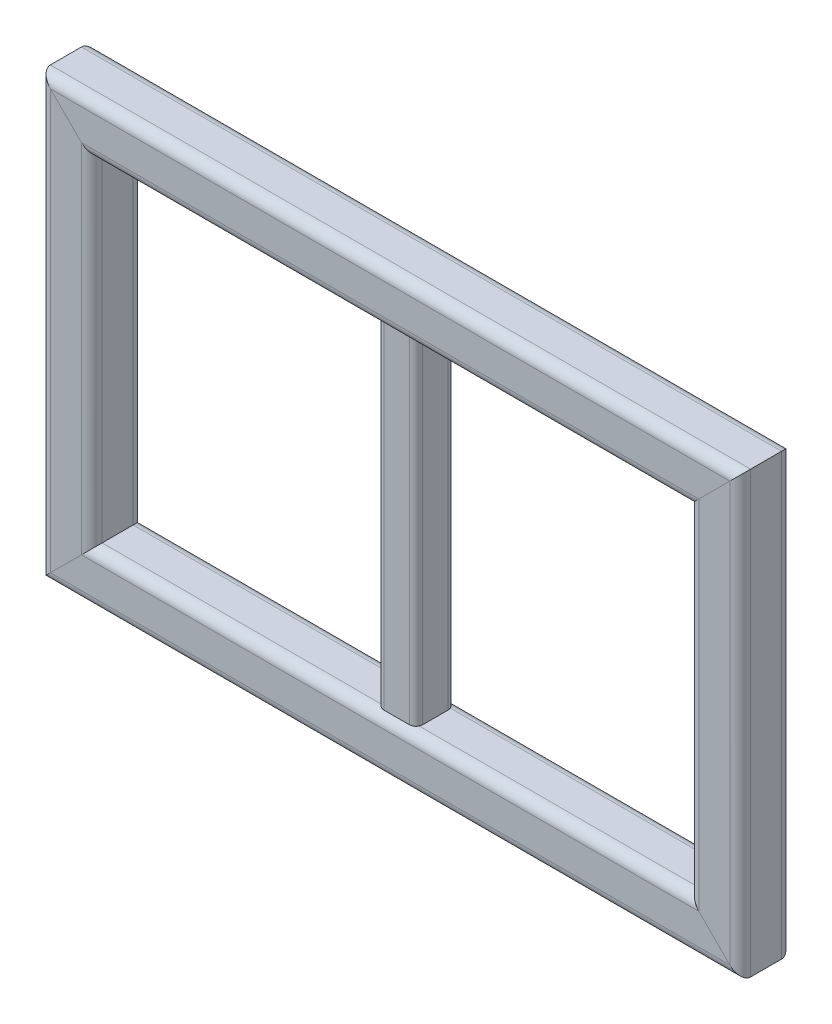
ISO-10303-21;
HEADER;
FILE_DESCRIPTION(('STEP AP214'),'2;1');
FILE_NAME('part.step','',(''),(''),'','','');
FILE_SCHEMA(('AUTOMOTIVE_DESIGN { 1 0 10303 214 1 1 1 1 }'));
ENDSEC;
DATA;
#1=APPLICATION_CONTEXT('core data for automotive mechanical design processes');
#2=APPLICATION_PROTOCOL_DEFINITION('international standard','automotive_design',2000,#1);
#3=PRODUCT_CONTEXT('',#1,'mechanical');
#4=PRODUCT('Part','Part','',(#3));
#5=PRODUCT_RELATED_PRODUCT_CATEGORY('part','',(#4));
#6=PRODUCT_DEFINITION_FORMATION('','',#4);
#7=PRODUCT_DEFINITION_CONTEXT('part definition',#1,'design');
#8=PRODUCT_DEFINITION('design','',#6,#7);
#9=PRODUCT_DEFINITION_SHAPE('','',#8);
#10=(LENGTH_UNIT() NAMED_UNIT(*) SI_UNIT(.MILLI.,.METRE.));
#11=(NAMED_UNIT(*) PLANE_ANGLE_UNIT() SI_UNIT($,.RADIAN.));
#12=(NAMED_UNIT(*) SI_UNIT($,.STERADIAN.) SOLID_ANGLE_UNIT());
#13=UNCERTAINTY_MEASURE_WITH_UNIT(LENGTH_MEASURE(1.E-05),#10,'distance_accuracy_value','');
#14=(GEOMETRIC_REPRESENTATION_CONTEXT(3) GLOBAL_UNCERTAINTY_ASSIGNED_CONTEXT((#13)) GLOBAL_UNIT_ASSIGNED_CONTEXT((#10,
#11,#12)) REPRESENTATION_CONTEXT('',''));
#15=CARTESIAN_POINT('',(0.,0.,0.));
#16=DIRECTION('',(0.,0.,1.));
#17=DIRECTION('',(1.,0.,0.));
#18=AXIS2_PLACEMENT_3D('',#15,#16,#17);
#19=CARTESIAN_POINT('',(-250.625000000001,-162.,12.));
#20=DIRECTION('',(1.,0.,0.));
#21=DIRECTION('',(0.,1.,0.));
#22=AXIS2_PLACEMENT_3D('',#19,#20,#21);
#23=CYLINDRICAL_SURFACE('',#22,8.);
#24=CARTESIAN_POINT('',(-262.625000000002,-162.,12.));
#25=DIRECTION('',(-0.707106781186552,0.70710678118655,0.));
#26=DIRECTION('',(0.707106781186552,0.70710678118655,0.));
#27=AXIS2_PLACEMENT_3D('',#24,#25,#26);
#28=ELLIPSE('',#27,11.3137084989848,8.);
#29=CARTESIAN_POINT('',(-270.625000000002,-170.,12.));
#30=VERTEX_POINT('',#29);
#31=CARTESIAN_POINT('',(-262.625000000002,-162.,20.));
#32=VERTEX_POINT('',#31);
#33=EDGE_CURVE('E177',#30,#32,#28,.T.);
#34=ORIENTED_EDGE('',*,*,#33,.F.);
#35=DIRECTION('',(1.,0.,0.));
#36=VECTOR('',#35,1.);
#37=CARTESIAN_POINT('',(-250.625000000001,-170.,12.));
#38=LINE('',#37,#36);
#39=CARTESIAN_POINT('',(270.625000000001,-170.,12.));
#40=VERTEX_POINT('',#39);
#41=EDGE_CURVE('E53',#30,#40,#38,.T.);
#42=ORIENTED_EDGE('',*,*,#41,.T.);
#43=CARTESIAN_POINT('',(262.625000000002,-162.,12.));
#44=DIRECTION('',(0.707106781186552,0.70710678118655,0.));
#45=DIRECTION('',(0.707106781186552,-0.70710678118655,0.));
#46=AXIS2_PLACEMENT_3D('',#43,#44,#45);
#47=ELLIPSE('',#46,11.3137084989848,8.);
#48=CARTESIAN_POINT('',(262.625000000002,-162.,20.));
#49=VERTEX_POINT('',#48);
#50=EDGE_CURVE('E258',#49,#40,#47,.T.);
#51=ORIENTED_EDGE('',*,*,#50,.F.);
#52=DIRECTION('',(1.,0.,0.));
#53=VECTOR('',#52,1.);
#54=CARTESIAN_POINT('',(-250.625000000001,-162.,20.));
#55=LINE('',#54,#53);
#56=EDGE_CURVE('E251',#32,#49,#55,.T.);
#57=ORIENTED_EDGE('',*,*,#56,.F.);
#58=EDGE_LOOP('',(#34,#42,#51,#57));
#59=FACE_BOUND('',#58,.T.);
#60=ADVANCED_FACE('F49',(#59),#23,.T.);
#61=CARTESIAN_POINT('',(-250.625000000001,-162.,20.));
#62=DIRECTION('',(0.,0.,-1.));
#63=DIRECTION('',(-1.,0.,0.));
#64=AXIS2_PLACEMENT_3D('',#61,#62,#63);
#65=PLANE('',#64);
#66=DIRECTION('',(0.707106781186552,0.70710678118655,0.));
#67=VECTOR('',#66,1.);
#68=CARTESIAN_POINT('',(-256.625000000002,-156.,20.));
#69=LINE('',#68,#67);
#70=CARTESIAN_POINT('',(-238.625000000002,-138.,20.));
#71=VERTEX_POINT('',#70);
#72=EDGE_CURVE('E195',#32,#71,#69,.T.);
#73=ORIENTED_EDGE('',*,*,#72,.F.);
#74=ORIENTED_EDGE('',*,*,#56,.T.);
#75=DIRECTION('',(0.707106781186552,-0.70710678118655,0.));
#76=VECTOR('',#75,1.);
#77=CARTESIAN_POINT('',(6.00000000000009,94.6250000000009,20.));
#78=LINE('',#77,#76);
#79=CARTESIAN_POINT('',(238.625000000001,-138.,20.));
#80=VERTEX_POINT('',#79);
#81=EDGE_CURVE('E167',#80,#49,#78,.T.);
#82=ORIENTED_EDGE('',*,*,#81,.F.);
#83=DIRECTION('',(1.,0.,0.));
#84=VECTOR('',#83,1.);
#85=CARTESIAN_POINT('',(-250.625000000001,-138.,20.));
#86=LINE('',#85,#84);
#87=EDGE_CURVE('E250',#71,#80,#86,.T.);
#88=ORIENTED_EDGE('',*,*,#87,.F.);
#89=EDGE_LOOP('',(#73,#74,#82,#88));
#90=FACE_BOUND('',#89,.T.);
#91=ADVANCED_FACE('F305',(#90),#65,.F.);
#92=CARTESIAN_POINT('',(-250.625000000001,-138.,12.));
#93=DIRECTION('',(1.,0.,0.));
#94=DIRECTION('',(0.,1.,0.));
#95=AXIS2_PLACEMENT_3D('',#92,#93,#94);
#96=CYLINDRICAL_SURFACE('',#95,8.);
#97=CARTESIAN_POINT('',(-238.625000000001,-138.,12.));
#98=DIRECTION('',(-0.707106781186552,0.70710678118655,0.));
#99=DIRECTION('',(0.707106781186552,0.70710678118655,0.));
#100=AXIS2_PLACEMENT_3D('',#97,#98,#99);
#101=ELLIPSE('',#100,11.3137084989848,8.);
#102=CARTESIAN_POINT('',(-230.625000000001,-130.,12.));
#103=VERTEX_POINT('',#102);
#104=EDGE_CURVE('E192',#71,#103,#101,.T.);
#105=ORIENTED_EDGE('',*,*,#104,.F.);
#106=ORIENTED_EDGE('',*,*,#87,.T.);
#107=CARTESIAN_POINT('',(238.625000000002,-138.,12.));
#108=DIRECTION('',(0.707106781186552,0.70710678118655,0.));
#109=DIRECTION('',(0.707106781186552,-0.70710678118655,0.));
#110=AXIS2_PLACEMENT_3D('',#107,#108,#109);
#111=ELLIPSE('',#110,11.3137084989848,8.);
#112=CARTESIAN_POINT('',(230.625000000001,-130.,12.));
#113=VERTEX_POINT('',#112);
#114=EDGE_CURVE('E178',#113,#80,#111,.T.);
#115=ORIENTED_EDGE('',*,*,#114,.F.);
#116=DIRECTION('',(1.,0.,0.));
#117=VECTOR('',#116,1.);
#118=CARTESIAN_POINT('',(-250.625000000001,-130.,12.));
#119=LINE('',#118,#117);
#120=EDGE_CURVE('E248',#103,#113,#119,.T.);
#121=ORIENTED_EDGE('',*,*,#120,.F.);
#122=EDGE_LOOP('',(#105,#106,#115,#121));
#123=FACE_BOUND('',#122,.T.);
#124=ADVANCED_FACE('F303',(#123),#96,.T.);
#125=CARTESIAN_POINT('',(-250.625000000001,-130.,-12.));
#126=DIRECTION('',(0.,-1.,0.));
#127=DIRECTION('',(1.,0.,0.));
#128=AXIS2_PLACEMENT_3D('',#125,#126,#127);
#129=PLANE('',#128);
#130=DIRECTION('',(0.,0.,-1.));
#131=VECTOR('',#130,1.);
#132=CARTESIAN_POINT('',(-230.625000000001,-130.,-12.));
#133=LINE('',#132,#131);
#134=CARTESIAN_POINT('',(-230.625000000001,-130.,-12.));
#135=VERTEX_POINT('',#134);
#136=EDGE_CURVE('E187',#103,#135,#133,.T.);
#137=ORIENTED_EDGE('',*,*,#136,.F.);
#138=ORIENTED_EDGE('',*,*,#120,.T.);
#139=DIRECTION('',(0.,0.,1.));
#140=VECTOR('',#139,1.);
#141=CARTESIAN_POINT('',(230.625000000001,-130.,-12.));
#142=LINE('',#141,#140);
#143=CARTESIAN_POINT('',(230.625000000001,-130.,-12.));
#144=VERTEX_POINT('',#143);
#145=EDGE_CURVE('E297',#144,#113,#142,.T.);
#146=ORIENTED_EDGE('',*,*,#145,.F.);
#147=DIRECTION('',(1.,0.,0.));
#148=VECTOR('',#147,1.);
#149=CARTESIAN_POINT('',(-250.625000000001,-130.,-12.));
#150=LINE('',#149,#148);
#151=EDGE_CURVE('E246',#135,#144,#150,.T.);
#152=ORIENTED_EDGE('',*,*,#151,.F.);
#153=EDGE_LOOP('',(#137,#138,#146,#152));
#154=FACE_BOUND('',#153,.T.);
#155=ADVANCED_FACE('F312',(#154),#129,.F.);
#156=CARTESIAN_POINT('',(-250.625000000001,-138.,-12.));
#157=DIRECTION('',(1.,0.,0.));
#158=DIRECTION('',(0.,1.,0.));
#159=AXIS2_PLACEMENT_3D('',#156,#157,#158);
#160=CYLINDRICAL_SURFACE('',#159,8.);
#161=CARTESIAN_POINT('',(-238.625000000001,-138.,-12.));
#162=DIRECTION('',(-0.707106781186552,0.70710678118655,0.));
#163=DIRECTION('',(0.707106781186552,0.70710678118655,0.));
#164=AXIS2_PLACEMENT_3D('',#161,#162,#163);
#165=ELLIPSE('',#164,11.3137084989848,8.);
#166=CARTESIAN_POINT('',(-238.625000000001,-138.,-20.));
#167=VERTEX_POINT('',#166);
#168=EDGE_CURVE('E183',#135,#167,#165,.T.);
#169=ORIENTED_EDGE('',*,*,#168,.F.);
#170=ORIENTED_EDGE('',*,*,#151,.T.);
#171=CARTESIAN_POINT('',(238.625000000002,-138.,-12.));
#172=DIRECTION('',(0.707106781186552,0.70710678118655,0.));
#173=DIRECTION('',(0.707106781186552,-0.70710678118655,0.));
#174=AXIS2_PLACEMENT_3D('',#171,#172,#173);
#175=ELLIPSE('',#174,11.3137084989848,8.);
#176=CARTESIAN_POINT('',(238.625000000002,-138.,-20.));
#177=VERTEX_POINT('',#176);
#178=EDGE_CURVE('E294',#177,#144,#175,.T.);
#179=ORIENTED_EDGE('',*,*,#178,.F.);
#180=DIRECTION('',(1.,0.,0.));
#181=VECTOR('',#180,1.);
#182=CARTESIAN_POINT('',(-250.625000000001,-138.,-20.));
#183=LINE('',#182,#181);
#184=EDGE_CURVE('E244',#167,#177,#183,.T.);
#185=ORIENTED_EDGE('',*,*,#184,.F.);
#186=EDGE_LOOP('',(#169,#170,#179,#185));
#187=FACE_BOUND('',#186,.T.);
#188=ADVANCED_FACE('F318',(#187),#160,.T.);
#189=CARTESIAN_POINT('',(-250.625000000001,-138.,-20.));
#190=DIRECTION('',(0.,0.,1.));
#191=DIRECTION('',(1.,0.,0.));
#192=AXIS2_PLACEMENT_3D('',#189,#190,#191);
#193=PLANE('',#192);
#194=DIRECTION('',(-0.707106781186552,-0.70710678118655,0.));
#195=VECTOR('',#194,1.);
#196=CARTESIAN_POINT('',(-244.625000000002,-144.,-20.));
#197=LINE('',#196,#195);
#198=CARTESIAN_POINT('',(-262.625000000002,-162.,-20.0000000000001));
#199=VERTEX_POINT('',#198);
#200=EDGE_CURVE('E59',#167,#199,#197,.T.);
#201=ORIENTED_EDGE('',*,*,#200,.F.);
#202=ORIENTED_EDGE('',*,*,#184,.T.);
#203=DIRECTION('',(-0.707106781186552,0.70710678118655,0.));
#204=VECTOR('',#203,1.);
#205=CARTESIAN_POINT('',(-6.00000000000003,106.625000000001,-20.));
#206=LINE('',#205,#204);
#207=CARTESIAN_POINT('',(262.625000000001,-162.,-20.));
#208=VERTEX_POINT('',#207);
#209=EDGE_CURVE('E291',#208,#177,#206,.T.);
#210=ORIENTED_EDGE('',*,*,#209,.F.);
#211=DIRECTION('',(1.,0.,0.));
#212=VECTOR('',#211,1.);
#213=CARTESIAN_POINT('',(-250.625000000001,-162.,-20.));
#214=LINE('',#213,#212);
#215=EDGE_CURVE('E202',#199,#208,#214,.T.);
#216=ORIENTED_EDGE('',*,*,#215,.F.);
#217=EDGE_LOOP('',(#201,#202,#210,#216));
#218=FACE_BOUND('',#217,.T.);
#219=ADVANCED_FACE('F322',(#218),#193,.F.);
#220=CARTESIAN_POINT('',(-250.625000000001,-162.,-12.));
#221=DIRECTION('',(1.,0.,0.));
#222=DIRECTION('',(0.,1.,0.));
#223=AXIS2_PLACEMENT_3D('',#220,#221,#222);
#224=CYLINDRICAL_SURFACE('',#223,8.);
#225=CARTESIAN_POINT('',(-262.625000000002,-162.,-12.));
#226=DIRECTION('',(-0.707106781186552,0.70710678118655,0.));
#227=DIRECTION('',(0.707106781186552,0.70710678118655,0.));
#228=AXIS2_PLACEMENT_3D('',#225,#226,#227);
#229=ELLIPSE('',#228,11.3137084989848,8.);
#230=CARTESIAN_POINT('',(-270.625000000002,-170.,-12.));
#231=VERTEX_POINT('',#230);
#232=EDGE_CURVE('E12',#199,#231,#229,.T.);
#233=ORIENTED_EDGE('',*,*,#232,.F.);
#234=ORIENTED_EDGE('',*,*,#215,.T.);
#235=CARTESIAN_POINT('',(262.625000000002,-162.,-12.));
#236=DIRECTION('',(0.707106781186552,0.70710678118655,0.));
#237=DIRECTION('',(0.707106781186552,-0.70710678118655,0.));
#238=AXIS2_PLACEMENT_3D('',#235,#236,#237);
#239=ELLIPSE('',#238,11.3137084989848,8.);
#240=CARTESIAN_POINT('',(270.625000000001,-170.,-12.));
#241=VERTEX_POINT('',#240);
#242=EDGE_CURVE('E163',#241,#208,#239,.T.);
#243=ORIENTED_EDGE('',*,*,#242,.F.);
#244=DIRECTION('',(1.,0.,0.));
#245=VECTOR('',#244,1.);
#246=CARTESIAN_POINT('',(-250.625000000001,-170.,-12.));
#247=LINE('',#246,#245);
#248=EDGE_CURVE('E158',#231,#241,#247,.T.);
#249=ORIENTED_EDGE('',*,*,#248,.F.);
#250=EDGE_LOOP('',(#233,#234,#243,#249));
#251=FACE_BOUND('',#250,.T.);
#252=ADVANCED_FACE('F160',(#251),#224,.T.);
#253=CARTESIAN_POINT('',(-250.625000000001,-138.,12.));
#254=DIRECTION('',(1.,0.,0.));
#255=DIRECTION('',(0.,1.,0.));
#256=AXIS2_PLACEMENT_3D('',#253,#254,#255);
#257=CYLINDRICAL_SURFACE('',#256,4.);
#258=DIRECTION('',(1.,0.,0.));
#259=VECTOR('',#258,1.);
#260=CARTESIAN_POINT('',(-250.625000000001,-138.,16.));
#261=LINE('',#260,#259);
#262=CARTESIAN_POINT('',(-238.625000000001,-138.,16.));
#263=VERTEX_POINT('',#262);
#264=CARTESIAN_POINT('',(238.625000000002,-138.,16.));
#265=VERTEX_POINT('',#264);
#266=EDGE_CURVE('E206',#263,#265,#261,.T.);
#267=ORIENTED_EDGE('',*,*,#266,.F.);
#268=CARTESIAN_POINT('',(-238.625000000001,-138.,12.));
#269=DIRECTION('',(-0.707106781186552,0.70710678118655,0.));
#270=DIRECTION('',(0.707106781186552,0.70710678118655,0.));
#271=AXIS2_PLACEMENT_3D('',#268,#269,#270);
#272=ELLIPSE('',#271,5.65685424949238,4.);
#273=CARTESIAN_POINT('',(-234.625000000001,-134.,12.));
#274=VERTEX_POINT('',#273);
#275=EDGE_CURVE('E199',#263,#274,#272,.T.);
#276=ORIENTED_EDGE('',*,*,#275,.T.);
#277=DIRECTION('',(1.,0.,0.));
#278=VECTOR('',#277,1.);
#279=CARTESIAN_POINT('',(-250.625000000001,-134.,12.));
#280=LINE('',#279,#278);
#281=CARTESIAN_POINT('',(234.625000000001,-134.,12.));
#282=VERTEX_POINT('',#281);
#283=EDGE_CURVE('E201',#274,#282,#280,.T.);
#284=ORIENTED_EDGE('',*,*,#283,.T.);
#285=CARTESIAN_POINT('',(238.625000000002,-138.,12.));
#286=DIRECTION('',(0.707106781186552,0.70710678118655,0.));
#287=DIRECTION('',(0.707106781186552,-0.70710678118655,0.));
#288=AXIS2_PLACEMENT_3D('',#285,#286,#287);
#289=ELLIPSE('',#288,5.65685424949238,4.);
#290=EDGE_CURVE('E207',#282,#265,#289,.T.);
#291=ORIENTED_EDGE('',*,*,#290,.T.);
#292=EDGE_LOOP('',(#267,#276,#284,#291));
#293=FACE_BOUND('',#292,.T.);
#294=ADVANCED_FACE('F328',(#293),#257,.F.);
#295=CARTESIAN_POINT('',(-250.625000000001,-162.,16.));
#296=DIRECTION('',(0.,0.,-1.));
#297=DIRECTION('',(-1.,0.,0.));
#298=AXIS2_PLACEMENT_3D('',#295,#296,#297);
#299=PLANE('',#298);
#300=DIRECTION('',(1.,0.,0.));
#301=VECTOR('',#300,1.);
#302=CARTESIAN_POINT('',(-250.625000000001,-162.,16.));
#303=LINE('',#302,#301);
#304=CARTESIAN_POINT('',(-262.625000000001,-162.,16.));
#305=VERTEX_POINT('',#304);
#306=CARTESIAN_POINT('',(262.625000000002,-162.,16.));
#307=VERTEX_POINT('',#306);
#308=EDGE_CURVE('E211',#305,#307,#303,.T.);
#309=ORIENTED_EDGE('',*,*,#308,.F.);
#310=DIRECTION('',(0.707106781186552,0.70710678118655,0.));
#311=VECTOR('',#310,1.);
#312=CARTESIAN_POINT('',(-256.625000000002,-156.,16.));
#313=LINE('',#312,#311);
#314=EDGE_CURVE('E203',#305,#263,#313,.T.);
#315=ORIENTED_EDGE('',*,*,#314,.T.);
#316=ORIENTED_EDGE('',*,*,#266,.T.);
#317=DIRECTION('',(0.707106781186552,-0.70710678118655,0.));
#318=VECTOR('',#317,1.);
#319=CARTESIAN_POINT('',(6.00000000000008,94.6250000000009,16.));
#320=LINE('',#319,#318);
#321=EDGE_CURVE('E212',#265,#307,#320,.T.);
#322=ORIENTED_EDGE('',*,*,#321,.T.);
#323=EDGE_LOOP('',(#309,#315,#316,#322));
#324=FACE_BOUND('',#323,.T.);
#325=ADVANCED_FACE('F334',(#324),#299,.T.);
#326=CARTESIAN_POINT('',(-250.625000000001,-162.,12.));
#327=DIRECTION('',(1.,0.,0.));
#328=DIRECTION('',(0.,1.,0.));
#329=AXIS2_PLACEMENT_3D('',#326,#327,#328);
#330=CYLINDRICAL_SURFACE('',#329,4.);
#331=DIRECTION('',(1.,0.,0.));
#332=VECTOR('',#331,1.);
#333=CARTESIAN_POINT('',(-250.625000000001,-166.,12.));
#334=LINE('',#333,#332);
#335=CARTESIAN_POINT('',(-266.625000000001,-166.,12.));
#336=VERTEX_POINT('',#335);
#337=CARTESIAN_POINT('',(266.625000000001,-166.,12.));
#338=VERTEX_POINT('',#337);
#339=EDGE_CURVE('E216',#336,#338,#334,.T.);
#340=ORIENTED_EDGE('',*,*,#339,.F.);
#341=CARTESIAN_POINT('',(-262.625000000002,-162.,12.));
#342=DIRECTION('',(-0.707106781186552,0.70710678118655,0.));
#343=DIRECTION('',(0.707106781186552,0.70710678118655,0.));
#344=AXIS2_PLACEMENT_3D('',#341,#342,#343);
#345=ELLIPSE('',#344,5.65685424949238,4.);
#346=EDGE_CURVE('E208',#336,#305,#345,.T.);
#347=ORIENTED_EDGE('',*,*,#346,.T.);
#348=ORIENTED_EDGE('',*,*,#308,.T.);
#349=CARTESIAN_POINT('',(262.625000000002,-162.,12.));
#350=DIRECTION('',(0.707106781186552,0.70710678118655,0.));
#351=DIRECTION('',(0.707106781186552,-0.70710678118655,0.));
#352=AXIS2_PLACEMENT_3D('',#349,#350,#351);
#353=ELLIPSE('',#352,5.65685424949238,4.);
#354=EDGE_CURVE('E217',#307,#338,#353,.T.);
#355=ORIENTED_EDGE('',*,*,#354,.T.);
#356=EDGE_LOOP('',(#340,#347,#348,#355));
#357=FACE_BOUND('',#356,.T.);
#358=ADVANCED_FACE('F338',(#357),#330,.F.);
#359=CARTESIAN_POINT('',(-250.625000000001,-166.,12.));
#360=DIRECTION('',(0.,1.,0.));
#361=DIRECTION('',(-1.,0.,0.));
#362=AXIS2_PLACEMENT_3D('',#359,#360,#361);
#363=PLANE('',#362);
#364=DIRECTION('',(1.,0.,0.));
#365=VECTOR('',#364,1.);
#366=CARTESIAN_POINT('',(-250.625000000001,-166.,-12.));
#367=LINE('',#366,#365);
#368=CARTESIAN_POINT('',(-266.625000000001,-166.,-12.));
#369=VERTEX_POINT('',#368);
#370=CARTESIAN_POINT('',(266.625000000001,-166.,-12.));
#371=VERTEX_POINT('',#370);
#372=EDGE_CURVE('E221',#369,#371,#367,.T.);
#373=ORIENTED_EDGE('',*,*,#372,.F.);
#374=DIRECTION('',(0.,0.,1.));
#375=VECTOR('',#374,1.);
#376=CARTESIAN_POINT('',(-266.625000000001,-166.,12.));
#377=LINE('',#376,#375);
#378=EDGE_CURVE('E213',#369,#336,#377,.T.);
#379=ORIENTED_EDGE('',*,*,#378,.T.);
#380=ORIENTED_EDGE('',*,*,#339,.T.);
#381=DIRECTION('',(0.,0.,-1.));
#382=VECTOR('',#381,1.);
#383=CARTESIAN_POINT('',(266.625000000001,-166.,12.));
#384=LINE('',#383,#382);
#385=EDGE_CURVE('E222',#338,#371,#384,.T.);
#386=ORIENTED_EDGE('',*,*,#385,.T.);
#387=EDGE_LOOP('',(#373,#379,#380,#386));
#388=FACE_BOUND('',#387,.T.);
#389=ADVANCED_FACE('F342',(#388),#363,.T.);
#390=CARTESIAN_POINT('',(-250.625000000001,-162.,-12.));
#391=DIRECTION('',(1.,0.,0.));
#392=DIRECTION('',(0.,1.,0.));
#393=AXIS2_PLACEMENT_3D('',#390,#391,#392);
#394=CYLINDRICAL_SURFACE('',#393,4.);
#395=DIRECTION('',(1.,0.,0.));
#396=VECTOR('',#395,1.);
#397=CARTESIAN_POINT('',(-250.625000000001,-162.,-16.));
#398=LINE('',#397,#396);
#399=CARTESIAN_POINT('',(-262.625000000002,-162.000000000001,-16.0000000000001));
#400=VERTEX_POINT('',#399);
#401=CARTESIAN_POINT('',(262.625000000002,-162.000000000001,-16.));
#402=VERTEX_POINT('',#401);
#403=EDGE_CURVE('E226',#400,#402,#398,.T.);
#404=ORIENTED_EDGE('',*,*,#403,.F.);
#405=CARTESIAN_POINT('',(-262.625000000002,-162.,-12.));
#406=DIRECTION('',(-0.707106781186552,0.70710678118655,0.));
#407=DIRECTION('',(0.707106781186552,0.70710678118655,0.));
#408=AXIS2_PLACEMENT_3D('',#405,#406,#407);
#409=ELLIPSE('',#408,5.65685424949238,4.);
#410=EDGE_CURVE('E218',#400,#369,#409,.T.);
#411=ORIENTED_EDGE('',*,*,#410,.T.);
#412=ORIENTED_EDGE('',*,*,#372,.T.);
#413=CARTESIAN_POINT('',(262.625000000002,-162.,-12.));
#414=DIRECTION('',(0.707106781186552,0.70710678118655,0.));
#415=DIRECTION('',(0.707106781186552,-0.70710678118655,0.));
#416=AXIS2_PLACEMENT_3D('',#413,#414,#415);
#417=ELLIPSE('',#416,5.65685424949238,4.);
#418=EDGE_CURVE('E227',#371,#402,#417,.T.);
#419=ORIENTED_EDGE('',*,*,#418,.T.);
#420=EDGE_LOOP('',(#404,#411,#412,#419));
#421=FACE_BOUND('',#420,.T.);
#422=ADVANCED_FACE('F346',(#421),#394,.F.);
#423=CARTESIAN_POINT('',(-250.625,-138.,-16.));
#424=DIRECTION('',(0.,0.,1.));
#425=DIRECTION('',(1.,0.,0.));
#426=AXIS2_PLACEMENT_3D('',#423,#424,#425);
#427=PLANE('',#426);
#428=DIRECTION('',(1.,0.,0.));
#429=VECTOR('',#428,1.);
#430=CARTESIAN_POINT('',(-250.625,-138.,-16.));
#431=LINE('',#430,#429);
#432=CARTESIAN_POINT('',(-238.625000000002,-138.,-16.));
#433=VERTEX_POINT('',#432);
#434=CARTESIAN_POINT('',(238.625000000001,-138.,-16.));
#435=VERTEX_POINT('',#434);
#436=EDGE_CURVE('E230',#433,#435,#431,.T.);
#437=ORIENTED_EDGE('',*,*,#436,.F.);
#438=DIRECTION('',(-0.707106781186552,-0.70710678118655,0.));
#439=VECTOR('',#438,1.);
#440=CARTESIAN_POINT('',(-244.625000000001,-144.,-16.));
#441=LINE('',#440,#439);
#442=EDGE_CURVE('E223',#433,#400,#441,.T.);
#443=ORIENTED_EDGE('',*,*,#442,.T.);
#444=ORIENTED_EDGE('',*,*,#403,.T.);
#445=DIRECTION('',(-0.707106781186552,0.70710678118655,0.));
#446=VECTOR('',#445,1.);
#447=CARTESIAN_POINT('',(-6.00000000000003,106.625000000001,-16.));
#448=LINE('',#447,#446);
#449=EDGE_CURVE('E231',#402,#435,#448,.T.);
#450=ORIENTED_EDGE('',*,*,#449,.T.);
#451=EDGE_LOOP('',(#437,#443,#444,#450));
#452=FACE_BOUND('',#451,.T.);
#453=ADVANCED_FACE('F350',(#452),#427,.T.);
#454=CARTESIAN_POINT('',(-250.625000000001,-138.,-12.));
#455=DIRECTION('',(1.,0.,0.));
#456=DIRECTION('',(0.,1.,0.));
#457=AXIS2_PLACEMENT_3D('',#454,#455,#456);
#458=CYLINDRICAL_SURFACE('',#457,4.);
#459=DIRECTION('',(1.,0.,0.));
#460=VECTOR('',#459,1.);
#461=CARTESIAN_POINT('',(-250.625000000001,-134.,-12.));
#462=LINE('',#461,#460);
#463=CARTESIAN_POINT('',(-234.625000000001,-134.,-12.));
#464=VERTEX_POINT('',#463);
#465=CARTESIAN_POINT('',(234.625000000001,-134.,-12.));
#466=VERTEX_POINT('',#465);
#467=EDGE_CURVE('E233',#464,#466,#462,.T.);
#468=ORIENTED_EDGE('',*,*,#467,.F.);
#469=CARTESIAN_POINT('',(-238.625000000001,-138.,-12.));
#470=DIRECTION('',(-0.707106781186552,0.70710678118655,0.));
#471=DIRECTION('',(0.707106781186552,0.70710678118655,0.));
#472=AXIS2_PLACEMENT_3D('',#469,#470,#471);
#473=ELLIPSE('',#472,5.65685424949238,4.);
#474=EDGE_CURVE('E228',#464,#433,#473,.T.);
#475=ORIENTED_EDGE('',*,*,#474,.T.);
#476=ORIENTED_EDGE('',*,*,#436,.T.);
#477=CARTESIAN_POINT('',(238.625000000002,-138.,-12.));
#478=DIRECTION('',(0.707106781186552,0.70710678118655,0.));
#479=DIRECTION('',(0.707106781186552,-0.70710678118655,0.));
#480=AXIS2_PLACEMENT_3D('',#477,#478,#479);
#481=ELLIPSE('',#480,5.65685424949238,4.);
#482=EDGE_CURVE('E236',#435,#466,#481,.T.);
#483=ORIENTED_EDGE('',*,*,#482,.T.);
#484=EDGE_LOOP('',(#468,#475,#476,#483));
#485=FACE_BOUND('',#484,.T.);
#486=ADVANCED_FACE('F354',(#485),#458,.F.);
#487=CARTESIAN_POINT('',(-250.625000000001,-134.,-12.));
#488=DIRECTION('',(0.,-1.,0.));
#489=DIRECTION('',(1.,0.,0.));
#490=AXIS2_PLACEMENT_3D('',#487,#488,#489);
#491=PLANE('',#490);
#492=ORIENTED_EDGE('',*,*,#283,.F.);
#493=DIRECTION('',(0.,0.,-1.));
#494=VECTOR('',#493,1.);
#495=CARTESIAN_POINT('',(-234.625000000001,-134.,-12.));
#496=LINE('',#495,#494);
#497=EDGE_CURVE('E67',#274,#464,#496,.T.);
#498=ORIENTED_EDGE('',*,*,#497,.T.);
#499=ORIENTED_EDGE('',*,*,#467,.T.);
#500=DIRECTION('',(0.,0.,1.));
#501=VECTOR('',#500,1.);
#502=CARTESIAN_POINT('',(234.625000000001,-134.,-12.));
#503=LINE('',#502,#501);
#504=EDGE_CURVE('E168',#466,#282,#503,.T.);
#505=ORIENTED_EDGE('',*,*,#504,.T.);
#506=EDGE_LOOP('',(#492,#498,#499,#505));
#507=FACE_BOUND('',#506,.T.);
#508=ADVANCED_FACE('F331',(#507),#491,.T.);
#509=CARTESIAN_POINT('',(-250.625000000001,-170.,12.));
#510=DIRECTION('',(0.,1.,0.));
#511=DIRECTION('',(-1.,0.,0.));
#512=AXIS2_PLACEMENT_3D('',#509,#510,#511);
#513=PLANE('',#512);
#514=DIRECTION('',(0.,0.,1.));
#515=VECTOR('',#514,1.);
#516=CARTESIAN_POINT('',(-270.625000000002,-170.,12.));
#517=LINE('',#516,#515);
#518=EDGE_CURVE('E172',#231,#30,#517,.T.);
#519=ORIENTED_EDGE('',*,*,#518,.F.);
#520=ORIENTED_EDGE('',*,*,#248,.T.);
#521=DIRECTION('',(0.,0.,-1.));
#522=VECTOR('',#521,1.);
#523=CARTESIAN_POINT('',(270.625000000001,-170.,12.));
#524=LINE('',#523,#522);
#525=EDGE_CURVE('E260',#40,#241,#524,.T.);
#526=ORIENTED_EDGE('',*,*,#525,.F.);
#527=ORIENTED_EDGE('',*,*,#41,.F.);
#528=EDGE_LOOP('',(#519,#520,#526,#527));
#529=FACE_BOUND('',#528,.T.);
#530=ADVANCED_FACE('F173',(#529),#513,.F.);
#531=CARTESIAN_POINT('',(250.625000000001,-150.,0.));
#532=DIRECTION('',(0.707106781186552,0.70710678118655,0.));
#533=DIRECTION('',(-0.707106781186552,0.70710678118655,0.));
#534=AXIS2_PLACEMENT_3D('',#531,#532,#533);
#535=PLANE('',#534);
#536=ORIENTED_EDGE('',*,*,#290,.F.);
#537=ORIENTED_EDGE('',*,*,#504,.F.);
#538=ORIENTED_EDGE('',*,*,#482,.F.);
#539=ORIENTED_EDGE('',*,*,#449,.F.);
#540=ORIENTED_EDGE('',*,*,#418,.F.);
#541=ORIENTED_EDGE('',*,*,#385,.F.);
#542=ORIENTED_EDGE('',*,*,#354,.F.);
#543=ORIENTED_EDGE('',*,*,#321,.F.);
#544=EDGE_LOOP('',(#536,#537,#538,#539,#540,#541,#542,#543));
#545=FACE_BOUND('',#544,.T.);
#546=ORIENTED_EDGE('',*,*,#81,.T.);
#547=ORIENTED_EDGE('',*,*,#50,.T.);
#548=ORIENTED_EDGE('',*,*,#525,.T.);
#549=ORIENTED_EDGE('',*,*,#242,.T.);
#550=ORIENTED_EDGE('',*,*,#209,.T.);
#551=ORIENTED_EDGE('',*,*,#178,.T.);
#552=ORIENTED_EDGE('',*,*,#145,.T.);
#553=ORIENTED_EDGE('',*,*,#114,.T.);
#554=EDGE_LOOP('',(#546,#547,#548,#549,#550,#551,#552,#553));
#555=FACE_BOUND('',#554,.T.);
#556=ADVANCED_FACE('F263',(#545,#555),#535,.T.);
#557=CARTESIAN_POINT('',(-250.625000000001,-150.,0.));
#558=DIRECTION('',(-0.707106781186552,0.70710678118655,0.));
#559=DIRECTION('',(-0.707106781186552,-0.70710678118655,0.));
#560=AXIS2_PLACEMENT_3D('',#557,#558,#559);
#561=PLANE('',#560);
#562=ORIENTED_EDGE('',*,*,#275,.F.);
#563=ORIENTED_EDGE('',*,*,#314,.F.);
#564=ORIENTED_EDGE('',*,*,#346,.F.);
#565=ORIENTED_EDGE('',*,*,#378,.F.);
#566=ORIENTED_EDGE('',*,*,#410,.F.);
#567=ORIENTED_EDGE('',*,*,#442,.F.);
#568=ORIENTED_EDGE('',*,*,#474,.F.);
#569=ORIENTED_EDGE('',*,*,#497,.F.);
#570=EDGE_LOOP('',(#562,#563,#564,#565,#566,#567,#568,#569));
#571=FACE_BOUND('',#570,.T.);
#572=ORIENTED_EDGE('',*,*,#518,.T.);
#573=ORIENTED_EDGE('',*,*,#33,.T.);
#574=ORIENTED_EDGE('',*,*,#72,.T.);
#575=ORIENTED_EDGE('',*,*,#104,.T.);
#576=ORIENTED_EDGE('',*,*,#136,.T.);
#577=ORIENTED_EDGE('',*,*,#168,.T.);
#578=ORIENTED_EDGE('',*,*,#200,.T.);
#579=ORIENTED_EDGE('',*,*,#232,.T.);
#580=EDGE_LOOP('',(#572,#573,#574,#575,#576,#577,#578,#579));
#581=FACE_BOUND('',#580,.T.);
#582=ADVANCED_FACE('F51',(#571,#581),#561,.T.);
#583=CLOSED_SHELL('',(#60,#91,#124,#155,#188,#219,#252,#294,#325,#358,#389,#422,#453,#486,#508,
#530,#556,#582));
#584=MANIFOLD_SOLID_BREP('B2',#583);
#585=CARTESIAN_POINT('',(-9.80000000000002,-150.,9.8));
#586=DIRECTION('',(0.,1.,0.));
#587=DIRECTION('',(-1.,0.,0.));
#588=AXIS2_PLACEMENT_3D('',#585,#586,#587);
#589=CYLINDRICAL_SURFACE('',#588,2.6);
#590=DIRECTION('',(0.,1.,0.));
#591=VECTOR('',#590,1.);
#592=CARTESIAN_POINT('',(-9.80000000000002,-150.,12.4));
#593=LINE('',#592,#591);
#594=CARTESIAN_POINT('',(-9.8000000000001,-130.,12.4));
#595=VERTEX_POINT('',#594);
#596=CARTESIAN_POINT('',(-9.80000000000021,130.,12.4));
#597=VERTEX_POINT('',#596);
#598=EDGE_CURVE('E660',#595,#597,#593,.T.);
#599=ORIENTED_EDGE('',*,*,#598,.F.);
#600=CARTESIAN_POINT('',(-9.80000000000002,-130.,9.8));
#601=DIRECTION('',(0.,-1.,0.));
#602=DIRECTION('',(1.,0.,0.));
#603=AXIS2_PLACEMENT_3D('',#600,#601,#602);
#604=CIRCLE('',#603,2.6);
#605=CARTESIAN_POINT('',(-12.4,-130.,9.8));
#606=VERTEX_POINT('',#605);
#607=EDGE_CURVE('E764',#595,#606,#604,.T.);
#608=ORIENTED_EDGE('',*,*,#607,.T.);
#609=DIRECTION('',(0.,1.,0.));
#610=VECTOR('',#609,1.);
#611=CARTESIAN_POINT('',(-12.4,-150.,9.8));
#612=LINE('',#611,#610);
#613=CARTESIAN_POINT('',(-12.4,130.,9.8));
#614=VERTEX_POINT('',#613);
#615=EDGE_CURVE('E645',#606,#614,#612,.T.);
#616=ORIENTED_EDGE('',*,*,#615,.T.);
#617=CARTESIAN_POINT('',(-9.79999999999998,130.,9.8));
#618=DIRECTION('',(0.,1.,0.));
#619=DIRECTION('',(-1.,0.,0.));
#620=AXIS2_PLACEMENT_3D('',#617,#618,#619);
#621=CIRCLE('',#620,2.6);
#622=EDGE_CURVE('E648',#614,#597,#621,.T.);
#623=ORIENTED_EDGE('',*,*,#622,.T.);
#624=EDGE_LOOP('',(#599,#608,#616,#623));
#625=FACE_BOUND('',#624,.T.);
#626=ADVANCED_FACE('F511',(#625),#589,.F.);
#627=CARTESIAN_POINT('',(9.79999999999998,-150.,12.4));
#628=DIRECTION('',(0.,0.,-1.));
#629=DIRECTION('',(-1.,0.,0.));
#630=AXIS2_PLACEMENT_3D('',#627,#628,#629);
#631=PLANE('',#630);
#632=DIRECTION('',(0.,1.,0.));
#633=VECTOR('',#632,1.);
#634=CARTESIAN_POINT('',(9.79999999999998,-150.,12.4));
#635=LINE('',#634,#633);
#636=CARTESIAN_POINT('',(9.80000000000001,-130.,12.4));
#637=VERTEX_POINT('',#636);
#638=CARTESIAN_POINT('',(9.80000000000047,130.,12.4));
#639=VERTEX_POINT('',#638);
#640=EDGE_CURVE('E658',#637,#639,#635,.T.);
#641=ORIENTED_EDGE('',*,*,#640,.F.);
#642=DIRECTION('',(-1.,0.,0.));
#643=VECTOR('',#642,1.);
#644=CARTESIAN_POINT('',(9.79999999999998,-130.,12.4));
#645=LINE('',#644,#643);
#646=EDGE_CURVE('E763',#637,#595,#645,.T.);
#647=ORIENTED_EDGE('',*,*,#646,.T.);
#648=ORIENTED_EDGE('',*,*,#598,.T.);
#649=DIRECTION('',(1.,0.,0.));
#650=VECTOR('',#649,1.);
#651=CARTESIAN_POINT('',(9.79999999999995,130.,12.4));
#652=LINE('',#651,#650);
#653=EDGE_CURVE('E722',#597,#639,#652,.T.);
#654=ORIENTED_EDGE('',*,*,#653,.T.);
#655=EDGE_LOOP('',(#641,#647,#648,#654));
#656=FACE_BOUND('',#655,.T.);
#657=ADVANCED_FACE('F762',(#656),#631,.T.);
#658=CARTESIAN_POINT('',(9.79999999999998,-150.,9.8));
#659=DIRECTION('',(0.,1.,0.));
#660=DIRECTION('',(-1.,0.,0.));
#661=AXIS2_PLACEMENT_3D('',#658,#659,#660);
#662=CYLINDRICAL_SURFACE('',#661,2.6);
#663=DIRECTION('',(0.,1.,0.));
#664=VECTOR('',#663,1.);
#665=CARTESIAN_POINT('',(12.4,-150.,9.8));
#666=LINE('',#665,#664);
#667=CARTESIAN_POINT('',(12.4,-130.,9.8));
#668=VERTEX_POINT('',#667);
#669=CARTESIAN_POINT('',(12.4,130.,9.8));
#670=VERTEX_POINT('',#669);
#671=EDGE_CURVE('E656',#668,#670,#666,.T.);
#672=ORIENTED_EDGE('',*,*,#671,.F.);
#673=CARTESIAN_POINT('',(9.79999999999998,-130.,9.8));
#674=DIRECTION('',(0.,-1.,0.));
#675=DIRECTION('',(1.,0.,0.));
#676=AXIS2_PLACEMENT_3D('',#673,#674,#675);
#677=CIRCLE('',#676,2.6);
#678=EDGE_CURVE('E761',#668,#637,#677,.T.);
#679=ORIENTED_EDGE('',*,*,#678,.T.);
#680=ORIENTED_EDGE('',*,*,#640,.T.);
#681=CARTESIAN_POINT('',(9.80000000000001,130.,9.8));
#682=DIRECTION('',(0.,1.,0.));
#683=DIRECTION('',(-1.,0.,0.));
#684=AXIS2_PLACEMENT_3D('',#681,#682,#683);
#685=CIRCLE('',#684,2.6);
#686=EDGE_CURVE('E720',#639,#670,#685,.T.);
#687=ORIENTED_EDGE('',*,*,#686,.T.);
#688=EDGE_LOOP('',(#672,#679,#680,#687));
#689=FACE_BOUND('',#688,.T.);
#690=ADVANCED_FACE('F760',(#689),#662,.F.);
#691=CARTESIAN_POINT('',(12.4,-150.,9.8));
#692=DIRECTION('',(-1.,0.,0.));
#693=DIRECTION('',(0.,-1.,0.));
#694=AXIS2_PLACEMENT_3D('',#691,#692,#693);
#695=PLANE('',#694);
#696=DIRECTION('',(0.,1.,0.));
#697=VECTOR('',#696,1.);
#698=CARTESIAN_POINT('',(12.4,-150.,-9.8));
#699=LINE('',#698,#697);
#700=CARTESIAN_POINT('',(12.4,-130.,-9.8));
#701=VERTEX_POINT('',#700);
#702=CARTESIAN_POINT('',(12.4,130.,-9.8));
#703=VERTEX_POINT('',#702);
#704=EDGE_CURVE('E654',#701,#703,#699,.T.);
#705=ORIENTED_EDGE('',*,*,#704,.F.);
#706=DIRECTION('',(0.,0.,1.));
#707=VECTOR('',#706,1.);
#708=CARTESIAN_POINT('',(12.4,-130.,9.8));
#709=LINE('',#708,#707);
#710=EDGE_CURVE('E757',#701,#668,#709,.T.);
#711=ORIENTED_EDGE('',*,*,#710,.T.);
#712=ORIENTED_EDGE('',*,*,#671,.T.);
#713=DIRECTION('',(0.,0.,-1.));
#714=VECTOR('',#713,1.);
#715=CARTESIAN_POINT('',(12.4,130.,9.8));
#716=LINE('',#715,#714);
#717=EDGE_CURVE('E717',#670,#703,#716,.T.);
#718=ORIENTED_EDGE('',*,*,#717,.T.);
#719=EDGE_LOOP('',(#705,#711,#712,#718));
#720=FACE_BOUND('',#719,.T.);
#721=ADVANCED_FACE('F754',(#720),#695,.T.);
#722=CARTESIAN_POINT('',(9.79999999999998,-150.,-9.8));
#723=DIRECTION('',(0.,1.,0.));
#724=DIRECTION('',(-1.,0.,0.));
#725=AXIS2_PLACEMENT_3D('',#722,#723,#724);
#726=CYLINDRICAL_SURFACE('',#725,2.6);
#727=DIRECTION('',(0.,1.,0.));
#728=VECTOR('',#727,1.);
#729=CARTESIAN_POINT('',(9.79999999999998,-150.,-12.4));
#730=LINE('',#729,#728);
#731=CARTESIAN_POINT('',(9.7999999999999,-130.,-12.4));
#732=VERTEX_POINT('',#731);
#733=CARTESIAN_POINT('',(9.80000000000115,130.,-12.4));
#734=VERTEX_POINT('',#733);
#735=EDGE_CURVE('E652',#732,#734,#730,.T.);
#736=ORIENTED_EDGE('',*,*,#735,.F.);
#737=CARTESIAN_POINT('',(9.79999999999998,-130.,-9.8));
#738=DIRECTION('',(0.,-1.,0.));
#739=DIRECTION('',(1.,0.,0.));
#740=AXIS2_PLACEMENT_3D('',#737,#738,#739);
#741=CIRCLE('',#740,2.6);
#742=EDGE_CURVE('E750',#732,#701,#741,.T.);
#743=ORIENTED_EDGE('',*,*,#742,.T.);
#744=ORIENTED_EDGE('',*,*,#704,.T.);
#745=CARTESIAN_POINT('',(9.80000000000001,130.,-9.8));
#746=DIRECTION('',(0.,1.,0.));
#747=DIRECTION('',(-1.,0.,0.));
#748=AXIS2_PLACEMENT_3D('',#745,#746,#747);
#749=CIRCLE('',#748,2.6);
#750=EDGE_CURVE('E714',#703,#734,#749,.T.);
#751=ORIENTED_EDGE('',*,*,#750,.T.);
#752=EDGE_LOOP('',(#736,#743,#744,#751));
#753=FACE_BOUND('',#752,.T.);
#754=ADVANCED_FACE('F749',(#753),#726,.F.);
#755=CARTESIAN_POINT('',(-9.80000000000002,-150.,-12.4));
#756=DIRECTION('',(0.,0.,1.));
#757=DIRECTION('',(1.,0.,0.));
#758=AXIS2_PLACEMENT_3D('',#755,#756,#757);
#759=PLANE('',#758);
#760=DIRECTION('',(0.,1.,0.));
#761=VECTOR('',#760,1.);
#762=CARTESIAN_POINT('',(-9.80000000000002,-150.,-12.4));
#763=LINE('',#762,#761);
#764=CARTESIAN_POINT('',(-9.80000000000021,-130.,-12.4));
#765=VERTEX_POINT('',#764);
#766=CARTESIAN_POINT('',(-9.79999999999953,130.,-12.4));
#767=VERTEX_POINT('',#766);
#768=EDGE_CURVE('E650',#765,#767,#763,.T.);
#769=ORIENTED_EDGE('',*,*,#768,.F.);
#770=DIRECTION('',(1.,0.,0.));
#771=VECTOR('',#770,1.);
#772=CARTESIAN_POINT('',(-9.80000000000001,-130.,-12.4));
#773=LINE('',#772,#771);
#774=EDGE_CURVE('E746',#765,#732,#773,.T.);
#775=ORIENTED_EDGE('',*,*,#774,.T.);
#776=ORIENTED_EDGE('',*,*,#735,.T.);
#777=DIRECTION('',(-1.,0.,0.));
#778=VECTOR('',#777,1.);
#779=CARTESIAN_POINT('',(-9.80000000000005,130.,-12.4));
#780=LINE('',#779,#778);
#781=EDGE_CURVE('E711',#734,#767,#780,.T.);
#782=ORIENTED_EDGE('',*,*,#781,.T.);
#783=EDGE_LOOP('',(#769,#775,#776,#782));
#784=FACE_BOUND('',#783,.T.);
#785=ADVANCED_FACE('F743',(#784),#759,.T.);
#786=CARTESIAN_POINT('',(-9.80000000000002,-150.,-9.8));
#787=DIRECTION('',(0.,1.,0.));
#788=DIRECTION('',(-1.,0.,0.));
#789=AXIS2_PLACEMENT_3D('',#786,#787,#788);
#790=CYLINDRICAL_SURFACE('',#789,2.6);
#791=DIRECTION('',(0.,1.,0.));
#792=VECTOR('',#791,1.);
#793=CARTESIAN_POINT('',(-12.4,-150.,-9.8));
#794=LINE('',#793,#792);
#795=CARTESIAN_POINT('',(-12.4,-130.,-9.8));
#796=VERTEX_POINT('',#795);
#797=CARTESIAN_POINT('',(-12.4,130.,-9.8));
#798=VERTEX_POINT('',#797);
#799=EDGE_CURVE('E647',#796,#798,#794,.T.);
#800=ORIENTED_EDGE('',*,*,#799,.F.);
#801=CARTESIAN_POINT('',(-9.80000000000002,-130.,-9.8));
#802=DIRECTION('',(0.,-1.,0.));
#803=DIRECTION('',(1.,0.,0.));
#804=AXIS2_PLACEMENT_3D('',#801,#802,#803);
#805=CIRCLE('',#804,2.6);
#806=EDGE_CURVE('E738',#796,#765,#805,.T.);
#807=ORIENTED_EDGE('',*,*,#806,.T.);
#808=ORIENTED_EDGE('',*,*,#768,.T.);
#809=CARTESIAN_POINT('',(-9.79999999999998,130.,-9.8));
#810=DIRECTION('',(0.,1.,0.));
#811=DIRECTION('',(-1.,0.,0.));
#812=AXIS2_PLACEMENT_3D('',#809,#810,#811);
#813=CIRCLE('',#812,2.6);
#814=EDGE_CURVE('E708',#767,#798,#813,.T.);
#815=ORIENTED_EDGE('',*,*,#814,.T.);
#816=EDGE_LOOP('',(#800,#807,#808,#815));
#817=FACE_BOUND('',#816,.T.);
#818=ADVANCED_FACE('F737',(#817),#790,.F.);
#819=CARTESIAN_POINT('',(-12.4,-150.,-9.8));
#820=DIRECTION('',(1.,0.,0.));
#821=DIRECTION('',(0.,1.,0.));
#822=AXIS2_PLACEMENT_3D('',#819,#820,#821);
#823=PLANE('',#822);
#824=ORIENTED_EDGE('',*,*,#615,.F.);
#825=DIRECTION('',(0.,0.,-1.));
#826=VECTOR('',#825,1.);
#827=CARTESIAN_POINT('',(-12.4,-130.,-9.8));
#828=LINE('',#827,#826);
#829=EDGE_CURVE('E525',#606,#796,#828,.T.);
#830=ORIENTED_EDGE('',*,*,#829,.T.);
#831=ORIENTED_EDGE('',*,*,#799,.T.);
#832=DIRECTION('',(0.,0.,1.));
#833=VECTOR('',#832,1.);
#834=CARTESIAN_POINT('',(-12.4,130.,-9.8));
#835=LINE('',#834,#833);
#836=EDGE_CURVE('E705',#798,#614,#835,.T.);
#837=ORIENTED_EDGE('',*,*,#836,.T.);
#838=EDGE_LOOP('',(#824,#830,#831,#837));
#839=FACE_BOUND('',#838,.T.);
#840=ADVANCED_FACE('F733',(#839),#823,.T.);
#841=CARTESIAN_POINT('',(250.625,130.,-12.));
#842=DIRECTION('',(0.,1.,0.));
#843=DIRECTION('',(-1.,0.,0.));
#844=AXIS2_PLACEMENT_3D('',#841,#842,#843);
#845=PLANE('',#844);
#846=ORIENTED_EDGE('',*,*,#836,.F.);
#847=ORIENTED_EDGE('',*,*,#814,.F.);
#848=ORIENTED_EDGE('',*,*,#781,.F.);
#849=ORIENTED_EDGE('',*,*,#750,.F.);
#850=ORIENTED_EDGE('',*,*,#717,.F.);
#851=ORIENTED_EDGE('',*,*,#686,.F.);
#852=ORIENTED_EDGE('',*,*,#653,.F.);
#853=ORIENTED_EDGE('',*,*,#622,.F.);
#854=EDGE_LOOP('',(#846,#847,#848,#849,#850,#851,#852,#853));
#855=FACE_BOUND('',#854,.T.);
#856=CARTESIAN_POINT('',(9.80000000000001,130.,9.8));
#857=DIRECTION('',(0.,1.,0.));
#858=DIRECTION('',(-1.,0.,0.));
#859=AXIS2_PLACEMENT_3D('',#856,#857,#858);
#860=CIRCLE('',#859,5.2);
#861=CARTESIAN_POINT('',(9.80000000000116,130.,15.));
#862=VERTEX_POINT('',#861);
#863=CARTESIAN_POINT('',(15.,130.,9.8));
#864=VERTEX_POINT('',#863);
#865=EDGE_CURVE('E638',#862,#864,#860,.T.);
#866=ORIENTED_EDGE('',*,*,#865,.T.);
#867=DIRECTION('',(0.,0.,-1.));
#868=VECTOR('',#867,1.);
#869=CARTESIAN_POINT('',(15.,130.,9.8));
#870=LINE('',#869,#868);
#871=CARTESIAN_POINT('',(15.,130.,-9.79999999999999));
#872=VERTEX_POINT('',#871);
#873=EDGE_CURVE('E518',#864,#872,#870,.T.);
#874=ORIENTED_EDGE('',*,*,#873,.T.);
#875=CARTESIAN_POINT('',(9.80000000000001,130.,-9.8));
#876=DIRECTION('',(0.,1.,0.));
#877=DIRECTION('',(-1.,0.,0.));
#878=AXIS2_PLACEMENT_3D('',#875,#876,#877);
#879=CIRCLE('',#878,5.2);
#880=CARTESIAN_POINT('',(9.80000000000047,130.,-15.));
#881=VERTEX_POINT('',#880);
#882=EDGE_CURVE('E775',#872,#881,#879,.T.);
#883=ORIENTED_EDGE('',*,*,#882,.T.);
#884=DIRECTION('',(-1.,0.,0.));
#885=VECTOR('',#884,1.);
#886=CARTESIAN_POINT('',(-9.80000000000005,130.,-15.));
#887=LINE('',#886,#885);
#888=CARTESIAN_POINT('',(-9.80000000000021,130.,-15.));
#889=VERTEX_POINT('',#888);
#890=EDGE_CURVE('E778',#881,#889,#887,.T.);
#891=ORIENTED_EDGE('',*,*,#890,.T.);
#892=CARTESIAN_POINT('',(-9.79999999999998,130.,-9.8));
#893=DIRECTION('',(0.,1.,0.));
#894=DIRECTION('',(-1.,0.,0.));
#895=AXIS2_PLACEMENT_3D('',#892,#893,#894);
#896=CIRCLE('',#895,5.2);
#897=CARTESIAN_POINT('',(-15.,130.,-9.8));
#898=VERTEX_POINT('',#897);
#899=EDGE_CURVE('E696',#889,#898,#896,.T.);
#900=ORIENTED_EDGE('',*,*,#899,.T.);
#901=DIRECTION('',(0.,0.,1.));
#902=VECTOR('',#901,1.);
#903=CARTESIAN_POINT('',(-15.,130.,-9.8));
#904=LINE('',#903,#902);
#905=CARTESIAN_POINT('',(-15.,130.,9.79999999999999));
#906=VERTEX_POINT('',#905);
#907=EDGE_CURVE('E685',#898,#906,#904,.T.);
#908=ORIENTED_EDGE('',*,*,#907,.T.);
#909=CARTESIAN_POINT('',(-9.79999999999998,130.,9.8));
#910=DIRECTION('',(0.,1.,0.));
#911=DIRECTION('',(-1.,0.,0.));
#912=AXIS2_PLACEMENT_3D('',#909,#910,#911);
#913=CIRCLE('',#912,5.2);
#914=CARTESIAN_POINT('',(-9.79999999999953,130.,15.));
#915=VERTEX_POINT('',#914);
#916=EDGE_CURVE('E693',#906,#915,#913,.T.);
#917=ORIENTED_EDGE('',*,*,#916,.T.);
#918=DIRECTION('',(1.,0.,0.));
#919=VECTOR('',#918,1.);
#920=CARTESIAN_POINT('',(9.79999999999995,130.,15.));
#921=LINE('',#920,#919);
#922=EDGE_CURVE('E699',#915,#862,#921,.T.);
#923=ORIENTED_EDGE('',*,*,#922,.T.);
#924=EDGE_LOOP('',(#866,#874,#883,#891,#900,#908,#917,#923));
#925=FACE_BOUND('',#924,.T.);
#926=ADVANCED_FACE('F692',(#855,#925),#845,.T.);
#927=CARTESIAN_POINT('',(9.79999999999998,-150.,9.8));
#928=DIRECTION('',(0.,1.,0.));
#929=DIRECTION('',(-1.,0.,0.));
#930=AXIS2_PLACEMENT_3D('',#927,#928,#929);
#931=CYLINDRICAL_SURFACE('',#930,5.2);
#932=CARTESIAN_POINT('',(9.79999999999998,-130.,9.8));
#933=DIRECTION('',(0.,-1.,0.));
#934=DIRECTION('',(1.,0.,0.));
#935=AXIS2_PLACEMENT_3D('',#932,#933,#934);
#936=CIRCLE('',#935,5.2);
#937=CARTESIAN_POINT('',(15.,-130.,9.8));
#938=VERTEX_POINT('',#937);
#939=CARTESIAN_POINT('',(9.79999999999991,-130.,15.));
#940=VERTEX_POINT('',#939);
#941=EDGE_CURVE('E47',#938,#940,#936,.T.);
#942=ORIENTED_EDGE('',*,*,#941,.F.);
#943=DIRECTION('',(0.,1.,0.));
#944=VECTOR('',#943,1.);
#945=CARTESIAN_POINT('',(15.,-150.,9.8));
#946=LINE('',#945,#944);
#947=EDGE_CURVE('E661',#938,#864,#946,.T.);
#948=ORIENTED_EDGE('',*,*,#947,.T.);
#949=ORIENTED_EDGE('',*,*,#865,.F.);
#950=DIRECTION('',(0.,1.,0.));
#951=VECTOR('',#950,1.);
#952=CARTESIAN_POINT('',(9.79999999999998,-150.,15.));
#953=LINE('',#952,#951);
#954=EDGE_CURVE('E630',#940,#862,#953,.T.);
#955=ORIENTED_EDGE('',*,*,#954,.F.);
#956=EDGE_LOOP('',(#942,#948,#949,#955));
#957=FACE_BOUND('',#956,.T.);
#958=ADVANCED_FACE('F636',(#957),#931,.T.);
#959=CARTESIAN_POINT('',(9.79999999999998,-150.,15.));
#960=DIRECTION('',(0.,0.,-1.));
#961=DIRECTION('',(-1.,0.,0.));
#962=AXIS2_PLACEMENT_3D('',#959,#960,#961);
#963=PLANE('',#962);
#964=DIRECTION('',(-1.,0.,0.));
#965=VECTOR('',#964,1.);
#966=CARTESIAN_POINT('',(9.79999999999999,-130.,15.));
#967=LINE('',#966,#965);
#968=CARTESIAN_POINT('',(-9.80000000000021,-130.,15.));
#969=VERTEX_POINT('',#968);
#970=EDGE_CURVE('E621',#940,#969,#967,.T.);
#971=ORIENTED_EDGE('',*,*,#970,.F.);
#972=ORIENTED_EDGE('',*,*,#954,.T.);
#973=ORIENTED_EDGE('',*,*,#922,.F.);
#974=DIRECTION('',(0.,1.,0.));
#975=VECTOR('',#974,1.);
#976=CARTESIAN_POINT('',(-9.80000000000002,-150.,15.));
#977=LINE('',#976,#975);
#978=EDGE_CURVE('E632',#969,#915,#977,.T.);
#979=ORIENTED_EDGE('',*,*,#978,.F.);
#980=EDGE_LOOP('',(#971,#972,#973,#979));
#981=FACE_BOUND('',#980,.T.);
#982=ADVANCED_FACE('F628',(#981),#963,.F.);
#983=CARTESIAN_POINT('',(-9.80000000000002,-150.,9.8));
#984=DIRECTION('',(0.,1.,0.));
#985=DIRECTION('',(-1.,0.,0.));
#986=AXIS2_PLACEMENT_3D('',#983,#984,#985);
#987=CYLINDRICAL_SURFACE('',#986,5.2);
#988=CARTESIAN_POINT('',(-9.80000000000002,-130.,9.8));
#989=DIRECTION('',(0.,-1.,0.));
#990=DIRECTION('',(1.,0.,0.));
#991=AXIS2_PLACEMENT_3D('',#988,#989,#990);
#992=CIRCLE('',#991,5.2);
#993=CARTESIAN_POINT('',(-15.,-130.,9.8));
#994=VERTEX_POINT('',#993);
#995=EDGE_CURVE('E633',#969,#994,#992,.T.);
#996=ORIENTED_EDGE('',*,*,#995,.F.);
#997=ORIENTED_EDGE('',*,*,#978,.T.);
#998=ORIENTED_EDGE('',*,*,#916,.F.);
#999=DIRECTION('',(0.,1.,0.));
#1000=VECTOR('',#999,1.);
#1001=CARTESIAN_POINT('',(-15.,-150.,9.8));
#1002=LINE('',#1001,#1000);
#1003=EDGE_CURVE('E641',#994,#906,#1002,.T.);
#1004=ORIENTED_EDGE('',*,*,#1003,.F.);
#1005=EDGE_LOOP('',(#996,#997,#998,#1004));
#1006=FACE_BOUND('',#1005,.T.);
#1007=ADVANCED_FACE('F698',(#1006),#987,.T.);
#1008=CARTESIAN_POINT('',(-15.,-150.,-9.8));
#1009=DIRECTION('',(1.,0.,0.));
#1010=DIRECTION('',(0.,1.,0.));
#1011=AXIS2_PLACEMENT_3D('',#1008,#1009,#1010);
#1012=PLANE('',#1011);
#1013=DIRECTION('',(0.,0.,-1.));
#1014=VECTOR('',#1013,1.);
#1015=CARTESIAN_POINT('',(-15.,-130.,-9.8));
#1016=LINE('',#1015,#1014);
#1017=CARTESIAN_POINT('',(-15.,-130.,-9.8));
#1018=VERTEX_POINT('',#1017);
#1019=EDGE_CURVE('E686',#994,#1018,#1016,.T.);
#1020=ORIENTED_EDGE('',*,*,#1019,.F.);
#1021=ORIENTED_EDGE('',*,*,#1003,.T.);
#1022=ORIENTED_EDGE('',*,*,#907,.F.);
#1023=DIRECTION('',(0.,1.,0.));
#1024=VECTOR('',#1023,1.);
#1025=CARTESIAN_POINT('',(-15.,-150.,-9.8));
#1026=LINE('',#1025,#1024);
#1027=EDGE_CURVE('E677',#1018,#898,#1026,.T.);
#1028=ORIENTED_EDGE('',*,*,#1027,.F.);
#1029=EDGE_LOOP('',(#1020,#1021,#1022,#1028));
#1030=FACE_BOUND('',#1029,.T.);
#1031=ADVANCED_FACE('F683',(#1030),#1012,.F.);
#1032=CARTESIAN_POINT('',(-9.80000000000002,-150.,-9.8));
#1033=DIRECTION('',(0.,1.,0.));
#1034=DIRECTION('',(-1.,0.,0.));
#1035=AXIS2_PLACEMENT_3D('',#1032,#1033,#1034);
#1036=CYLINDRICAL_SURFACE('',#1035,5.2);
#1037=CARTESIAN_POINT('',(-9.80000000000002,-130.,-9.8));
#1038=DIRECTION('',(0.,-1.,0.));
#1039=DIRECTION('',(1.,0.,0.));
#1040=AXIS2_PLACEMENT_3D('',#1037,#1038,#1039);
#1041=CIRCLE('',#1040,5.2);
#1042=CARTESIAN_POINT('',(-9.8000000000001,-130.,-15.));
#1043=VERTEX_POINT('',#1042);
#1044=EDGE_CURVE('E787',#1018,#1043,#1041,.T.);
#1045=ORIENTED_EDGE('',*,*,#1044,.F.);
#1046=ORIENTED_EDGE('',*,*,#1027,.T.);
#1047=ORIENTED_EDGE('',*,*,#899,.F.);
#1048=DIRECTION('',(0.,1.,0.));
#1049=VECTOR('',#1048,1.);
#1050=CARTESIAN_POINT('',(-9.80000000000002,-150.,-15.));
#1051=LINE('',#1050,#1049);
#1052=EDGE_CURVE('E675',#1043,#889,#1051,.T.);
#1053=ORIENTED_EDGE('',*,*,#1052,.F.);
#1054=EDGE_LOOP('',(#1045,#1046,#1047,#1053));
#1055=FACE_BOUND('',#1054,.T.);
#1056=ADVANCED_FACE('F786',(#1055),#1036,.T.);
#1057=CARTESIAN_POINT('',(-9.80000000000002,-150.,-15.));
#1058=DIRECTION('',(0.,0.,1.));
#1059=DIRECTION('',(1.,0.,0.));
#1060=AXIS2_PLACEMENT_3D('',#1057,#1058,#1059);
#1061=PLANE('',#1060);
#1062=DIRECTION('',(1.,0.,0.));
#1063=VECTOR('',#1062,1.);
#1064=CARTESIAN_POINT('',(-9.80000000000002,-130.,-15.));
#1065=LINE('',#1064,#1063);
#1066=CARTESIAN_POINT('',(9.80000000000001,-130.,-15.));
#1067=VERTEX_POINT('',#1066);
#1068=EDGE_CURVE('E789',#1043,#1067,#1065,.T.);
#1069=ORIENTED_EDGE('',*,*,#1068,.F.);
#1070=ORIENTED_EDGE('',*,*,#1052,.T.);
#1071=ORIENTED_EDGE('',*,*,#890,.F.);
#1072=DIRECTION('',(0.,1.,0.));
#1073=VECTOR('',#1072,1.);
#1074=CARTESIAN_POINT('',(9.79999999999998,-150.,-15.));
#1075=LINE('',#1074,#1073);
#1076=EDGE_CURVE('E669',#1067,#881,#1075,.T.);
#1077=ORIENTED_EDGE('',*,*,#1076,.F.);
#1078=EDGE_LOOP('',(#1069,#1070,#1071,#1077));
#1079=FACE_BOUND('',#1078,.T.);
#1080=ADVANCED_FACE('F803',(#1079),#1061,.F.);
#1081=CARTESIAN_POINT('',(9.79999999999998,-150.,-9.8));
#1082=DIRECTION('',(0.,1.,0.));
#1083=DIRECTION('',(-1.,0.,0.));
#1084=AXIS2_PLACEMENT_3D('',#1081,#1082,#1083);
#1085=CYLINDRICAL_SURFACE('',#1084,5.2);
#1086=CARTESIAN_POINT('',(9.79999999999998,-130.,-9.8));
#1087=DIRECTION('',(0.,-1.,0.));
#1088=DIRECTION('',(1.,0.,0.));
#1089=AXIS2_PLACEMENT_3D('',#1086,#1087,#1088);
#1090=CIRCLE('',#1089,5.2);
#1091=CARTESIAN_POINT('',(15.,-130.,-9.8));
#1092=VERTEX_POINT('',#1091);
#1093=EDGE_CURVE('E791',#1067,#1092,#1090,.T.);
#1094=ORIENTED_EDGE('',*,*,#1093,.F.);
#1095=ORIENTED_EDGE('',*,*,#1076,.T.);
#1096=ORIENTED_EDGE('',*,*,#882,.F.);
#1097=DIRECTION('',(0.,1.,0.));
#1098=VECTOR('',#1097,1.);
#1099=CARTESIAN_POINT('',(15.,-150.,-9.8));
#1100=LINE('',#1099,#1098);
#1101=EDGE_CURVE('E667',#1092,#872,#1100,.T.);
#1102=ORIENTED_EDGE('',*,*,#1101,.F.);
#1103=EDGE_LOOP('',(#1094,#1095,#1096,#1102));
#1104=FACE_BOUND('',#1103,.T.);
#1105=ADVANCED_FACE('F802',(#1104),#1085,.T.);
#1106=CARTESIAN_POINT('',(15.,-150.,9.8));
#1107=DIRECTION('',(-1.,0.,0.));
#1108=DIRECTION('',(0.,-1.,0.));
#1109=AXIS2_PLACEMENT_3D('',#1106,#1107,#1108);
#1110=PLANE('',#1109);
#1111=DIRECTION('',(0.,0.,1.));
#1112=VECTOR('',#1111,1.);
#1113=CARTESIAN_POINT('',(15.,-130.,9.8));
#1114=LINE('',#1113,#1112);
#1115=EDGE_CURVE('E532',#1092,#938,#1114,.T.);
#1116=ORIENTED_EDGE('',*,*,#1115,.F.);
#1117=ORIENTED_EDGE('',*,*,#1101,.T.);
#1118=ORIENTED_EDGE('',*,*,#873,.F.);
#1119=ORIENTED_EDGE('',*,*,#947,.F.);
#1120=EDGE_LOOP('',(#1116,#1117,#1118,#1119));
#1121=FACE_BOUND('',#1120,.T.);
#1122=ADVANCED_FACE('F800',(#1121),#1110,.F.);
#1123=CARTESIAN_POINT('',(-250.625,-130.,-12.));
#1124=DIRECTION('',(0.,-1.,0.));
#1125=DIRECTION('',(1.,0.,0.));
#1126=AXIS2_PLACEMENT_3D('',#1123,#1124,#1125);
#1127=PLANE('',#1126);
#1128=ORIENTED_EDGE('',*,*,#607,.F.);
#1129=ORIENTED_EDGE('',*,*,#646,.F.);
#1130=ORIENTED_EDGE('',*,*,#678,.F.);
#1131=ORIENTED_EDGE('',*,*,#710,.F.);
#1132=ORIENTED_EDGE('',*,*,#742,.F.);
#1133=ORIENTED_EDGE('',*,*,#774,.F.);
#1134=ORIENTED_EDGE('',*,*,#806,.F.);
#1135=ORIENTED_EDGE('',*,*,#829,.F.);
#1136=EDGE_LOOP('',(#1128,#1129,#1130,#1131,#1132,#1133,#1134,#1135));
#1137=FACE_BOUND('',#1136,.T.);
#1138=ORIENTED_EDGE('',*,*,#1115,.T.);
#1139=ORIENTED_EDGE('',*,*,#941,.T.);
#1140=ORIENTED_EDGE('',*,*,#970,.T.);
#1141=ORIENTED_EDGE('',*,*,#995,.T.);
#1142=ORIENTED_EDGE('',*,*,#1019,.T.);
#1143=ORIENTED_EDGE('',*,*,#1044,.T.);
#1144=ORIENTED_EDGE('',*,*,#1068,.T.);
#1145=ORIENTED_EDGE('',*,*,#1093,.T.);
#1146=EDGE_LOOP('',(#1138,#1139,#1140,#1141,#1142,#1143,#1144,#1145));
#1147=FACE_BOUND('',#1146,.T.);
#1148=ADVANCED_FACE('F620',(#1137,#1147),#1127,.T.);
#1149=CLOSED_SHELL('',(#626,#657,#690,#721,#754,#785,#818,#840,#926,#958,#982,#1007,#1031,#1056,
#1080,#1105,#1122,#1148));
#1150=MANIFOLD_SOLID_BREP('B6',#1149);
#1151=CARTESIAN_POINT('',(250.625000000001,162.,12.));
#1152=DIRECTION('',(-1.,0.,0.));
#1153=DIRECTION('',(0.,-1.,0.));
#1154=AXIS2_PLACEMENT_3D('',#1151,#1152,#1153);
#1155=CYLINDRICAL_SURFACE('',#1154,8.);
#1156=CARTESIAN_POINT('',(-262.625000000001,162.,12.));
#1157=DIRECTION('',(-0.70710678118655,-0.70710678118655,0.));
#1158=DIRECTION('',(-0.70710678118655,0.70710678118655,0.));
#1159=AXIS2_PLACEMENT_3D('',#1156,#1157,#1158);
#1160=ELLIPSE('',#1159,11.3137084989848,8.);
#1161=CARTESIAN_POINT('',(-262.625000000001,162.,20.));
#1162=VERTEX_POINT('',#1161);
#1163=CARTESIAN_POINT('',(-270.625,170.,12.));
#1164=VERTEX_POINT('',#1163);
#1165=EDGE_CURVE('E1138',#1162,#1164,#1160,.T.);
#1166=ORIENTED_EDGE('',*,*,#1165,.F.);
#1167=DIRECTION('',(-1.,0.,0.));
#1168=VECTOR('',#1167,1.);
#1169=CARTESIAN_POINT('',(250.625,162.,20.));
#1170=LINE('',#1169,#1168);
#1171=CARTESIAN_POINT('',(262.625000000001,162.,20.0000000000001));
#1172=VERTEX_POINT('',#1171);
#1173=EDGE_CURVE('E1218',#1172,#1162,#1170,.T.);
#1174=ORIENTED_EDGE('',*,*,#1173,.F.);
#1175=CARTESIAN_POINT('',(262.625000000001,162.,12.));
#1176=DIRECTION('',(0.70710678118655,-0.70710678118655,0.));
#1177=DIRECTION('',(-0.70710678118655,-0.70710678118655,0.));
#1178=AXIS2_PLACEMENT_3D('',#1175,#1176,#1177);
#1179=ELLIPSE('',#1178,11.3137084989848,8.);
#1180=CARTESIAN_POINT('',(270.625000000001,170.,12.));
#1181=VERTEX_POINT('',#1180);
#1182=EDGE_CURVE('E1129',#1181,#1172,#1179,.T.);
#1183=ORIENTED_EDGE('',*,*,#1182,.F.);
#1184=DIRECTION('',(-1.,0.,0.));
#1185=VECTOR('',#1184,1.);
#1186=CARTESIAN_POINT('',(250.625000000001,170.,12.));
#1187=LINE('',#1186,#1185);
#1188=EDGE_CURVE('E998',#1181,#1164,#1187,.T.);
#1189=ORIENTED_EDGE('',*,*,#1188,.T.);
#1190=EDGE_LOOP('',(#1166,#1174,#1183,#1189));
#1191=FACE_BOUND('',#1190,.T.);
#1192=ADVANCED_FACE('F994',(#1191),#1155,.T.);
#1193=CARTESIAN_POINT('',(250.625,162.,20.));
#1194=DIRECTION('',(0.,0.,-1.));
#1195=DIRECTION('',(-1.,0.,0.));
#1196=AXIS2_PLACEMENT_3D('',#1193,#1194,#1195);
#1197=PLANE('',#1196);
#1198=DIRECTION('',(-0.70710678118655,0.70710678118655,0.));
#1199=VECTOR('',#1198,1.);
#1200=CARTESIAN_POINT('',(-6.00000000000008,-94.6250000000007,20.));
#1201=LINE('',#1200,#1199);
#1202=CARTESIAN_POINT('',(-238.625000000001,138.,20.0000000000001));
#1203=VERTEX_POINT('',#1202);
#1204=EDGE_CURVE('E1135',#1203,#1162,#1201,.T.);
#1205=ORIENTED_EDGE('',*,*,#1204,.F.);
#1206=DIRECTION('',(-1.,0.,0.));
#1207=VECTOR('',#1206,1.);
#1208=CARTESIAN_POINT('',(250.625,138.,20.));
#1209=LINE('',#1208,#1207);
#1210=CARTESIAN_POINT('',(238.625000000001,138.,20.0000000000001));
#1211=VERTEX_POINT('',#1210);
#1212=EDGE_CURVE('E1216',#1211,#1203,#1209,.T.);
#1213=ORIENTED_EDGE('',*,*,#1212,.F.);
#1214=DIRECTION('',(-0.70710678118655,-0.70710678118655,0.));
#1215=VECTOR('',#1214,1.);
#1216=CARTESIAN_POINT('',(256.625,156.,20.));
#1217=LINE('',#1216,#1215);
#1218=EDGE_CURVE('E1234',#1172,#1211,#1217,.T.);
#1219=ORIENTED_EDGE('',*,*,#1218,.F.);
#1220=ORIENTED_EDGE('',*,*,#1173,.T.);
#1221=EDGE_LOOP('',(#1205,#1213,#1219,#1220));
#1222=FACE_BOUND('',#1221,.T.);
#1223=ADVANCED_FACE('F1225',(#1222),#1197,.F.);
#1224=CARTESIAN_POINT('',(250.625000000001,138.,12.));
#1225=DIRECTION('',(-1.,0.,0.));
#1226=DIRECTION('',(0.,-1.,0.));
#1227=AXIS2_PLACEMENT_3D('',#1224,#1225,#1226);
#1228=CYLINDRICAL_SURFACE('',#1227,8.);
#1229=CARTESIAN_POINT('',(-238.625000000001,138.,12.));
#1230=DIRECTION('',(-0.70710678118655,-0.70710678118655,0.));
#1231=DIRECTION('',(-0.70710678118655,0.70710678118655,0.));
#1232=AXIS2_PLACEMENT_3D('',#1229,#1230,#1231);
#1233=ELLIPSE('',#1232,11.3137084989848,8.);
#1234=CARTESIAN_POINT('',(-230.625000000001,130.,12.));
#1235=VERTEX_POINT('',#1234);
#1236=EDGE_CURVE('E509',#1235,#1203,#1233,.T.);
#1237=ORIENTED_EDGE('',*,*,#1236,.F.);
#1238=DIRECTION('',(-1.,0.,0.));
#1239=VECTOR('',#1238,1.);
#1240=CARTESIAN_POINT('',(250.625000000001,130.,12.));
#1241=LINE('',#1240,#1239);
#1242=CARTESIAN_POINT('',(230.625,130.,12.));
#1243=VERTEX_POINT('',#1242);
#1244=EDGE_CURVE('E1213',#1243,#1235,#1241,.T.);
#1245=ORIENTED_EDGE('',*,*,#1244,.F.);
#1246=CARTESIAN_POINT('',(238.625000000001,138.,12.));
#1247=DIRECTION('',(0.70710678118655,-0.70710678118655,0.));
#1248=DIRECTION('',(-0.70710678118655,-0.70710678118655,0.));
#1249=AXIS2_PLACEMENT_3D('',#1246,#1247,#1248);
#1250=ELLIPSE('',#1249,11.3137084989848,8.);
#1251=EDGE_CURVE('E1231',#1211,#1243,#1250,.T.);
#1252=ORIENTED_EDGE('',*,*,#1251,.F.);
#1253=ORIENTED_EDGE('',*,*,#1212,.T.);
#1254=EDGE_LOOP('',(#1237,#1245,#1252,#1253));
#1255=FACE_BOUND('',#1254,.T.);
#1256=ADVANCED_FACE('F1228',(#1255),#1228,.T.);
#1257=CARTESIAN_POINT('',(250.625000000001,130.,-12.));
#1258=DIRECTION('',(0.,1.,0.));
#1259=DIRECTION('',(-1.,0.,0.));
#1260=AXIS2_PLACEMENT_3D('',#1257,#1258,#1259);
#1261=PLANE('',#1260);
#1262=DIRECTION('',(0.,0.,1.));
#1263=VECTOR('',#1262,1.);
#1264=CARTESIAN_POINT('',(-230.625000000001,130.,-12.));
#1265=LINE('',#1264,#1263);
#1266=CARTESIAN_POINT('',(-230.625000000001,130.,-12.));
#1267=VERTEX_POINT('',#1266);
#1268=EDGE_CURVE('E1004',#1267,#1235,#1265,.T.);
#1269=ORIENTED_EDGE('',*,*,#1268,.F.);
#1270=DIRECTION('',(-1.,0.,0.));
#1271=VECTOR('',#1270,1.);
#1272=CARTESIAN_POINT('',(250.625000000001,130.,-12.));
#1273=LINE('',#1272,#1271);
#1274=CARTESIAN_POINT('',(230.625000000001,130.,-12.));
#1275=VERTEX_POINT('',#1274);
#1276=EDGE_CURVE('E1210',#1275,#1267,#1273,.T.);
#1277=ORIENTED_EDGE('',*,*,#1276,.F.);
#1278=DIRECTION('',(0.,0.,-1.));
#1279=VECTOR('',#1278,1.);
#1280=CARTESIAN_POINT('',(230.625000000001,130.,-12.));
#1281=LINE('',#1280,#1279);
#1282=EDGE_CURVE('E1233',#1243,#1275,#1281,.T.);
#1283=ORIENTED_EDGE('',*,*,#1282,.F.);
#1284=ORIENTED_EDGE('',*,*,#1244,.T.);
#1285=EDGE_LOOP('',(#1269,#1277,#1283,#1284));
#1286=FACE_BOUND('',#1285,.T.);
#1287=ADVANCED_FACE('F1244',(#1286),#1261,.F.);
#1288=CARTESIAN_POINT('',(250.625,138.,-12.));
#1289=DIRECTION('',(-1.,0.,0.));
#1290=DIRECTION('',(0.,-1.,0.));
#1291=AXIS2_PLACEMENT_3D('',#1288,#1289,#1290);
#1292=CYLINDRICAL_SURFACE('',#1291,8.);
#1293=CARTESIAN_POINT('',(-238.625000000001,138.,-12.));
#1294=DIRECTION('',(-0.70710678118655,-0.70710678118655,0.));
#1295=DIRECTION('',(-0.70710678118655,0.70710678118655,0.));
#1296=AXIS2_PLACEMENT_3D('',#1293,#1294,#1295);
#1297=ELLIPSE('',#1296,11.3137084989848,8.);
#1298=CARTESIAN_POINT('',(-238.625000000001,138.,-20.0000000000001));
#1299=VERTEX_POINT('',#1298);
#1300=EDGE_CURVE('E1153',#1299,#1267,#1297,.T.);
#1301=ORIENTED_EDGE('',*,*,#1300,.F.);
#1302=DIRECTION('',(-1.,0.,0.));
#1303=VECTOR('',#1302,1.);
#1304=CARTESIAN_POINT('',(250.625,138.,-20.0000000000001));
#1305=LINE('',#1304,#1303);
#1306=CARTESIAN_POINT('',(238.625000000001,138.,-20.0000000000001));
#1307=VERTEX_POINT('',#1306);
#1308=EDGE_CURVE('E1207',#1307,#1299,#1305,.T.);
#1309=ORIENTED_EDGE('',*,*,#1308,.F.);
#1310=CARTESIAN_POINT('',(238.625000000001,138.,-12.));
#1311=DIRECTION('',(0.70710678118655,-0.70710678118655,0.));
#1312=DIRECTION('',(-0.70710678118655,-0.70710678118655,0.));
#1313=AXIS2_PLACEMENT_3D('',#1310,#1311,#1312);
#1314=ELLIPSE('',#1313,11.3137084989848,8.);
#1315=EDGE_CURVE('E1140',#1275,#1307,#1314,.T.);
#1316=ORIENTED_EDGE('',*,*,#1315,.F.);
#1317=ORIENTED_EDGE('',*,*,#1276,.T.);
#1318=EDGE_LOOP('',(#1301,#1309,#1316,#1317));
#1319=FACE_BOUND('',#1318,.T.);
#1320=ADVANCED_FACE('F1242',(#1319),#1292,.T.);
#1321=CARTESIAN_POINT('',(250.625,138.,-20.0000000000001));
#1322=DIRECTION('',(0.,0.,1.));
#1323=DIRECTION('',(1.,0.,0.));
#1324=AXIS2_PLACEMENT_3D('',#1321,#1322,#1323);
#1325=PLANE('',#1324);
#1326=DIRECTION('',(0.70710678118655,-0.70710678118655,0.));
#1327=VECTOR('',#1326,1.);
#1328=CARTESIAN_POINT('',(5.99999999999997,-106.625000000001,-20.0000000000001));
#1329=LINE('',#1328,#1327);
#1330=CARTESIAN_POINT('',(-262.625000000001,162.,-20.0000000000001));
#1331=VERTEX_POINT('',#1330);
#1332=EDGE_CURVE('E1156',#1331,#1299,#1329,.T.);
#1333=ORIENTED_EDGE('',*,*,#1332,.F.);
#1334=DIRECTION('',(-1.,0.,0.));
#1335=VECTOR('',#1334,1.);
#1336=CARTESIAN_POINT('',(250.625000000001,162.,-20.0000000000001));
#1337=LINE('',#1336,#1335);
#1338=CARTESIAN_POINT('',(262.625000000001,162.,-20.0000000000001));
#1339=VERTEX_POINT('',#1338);
#1340=EDGE_CURVE('E1205',#1339,#1331,#1337,.T.);
#1341=ORIENTED_EDGE('',*,*,#1340,.F.);
#1342=DIRECTION('',(0.70710678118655,0.70710678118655,0.));
#1343=VECTOR('',#1342,1.);
#1344=CARTESIAN_POINT('',(244.625000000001,144.,-20.0000000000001));
#1345=LINE('',#1344,#1343);
#1346=EDGE_CURVE('E1134',#1307,#1339,#1345,.T.);
#1347=ORIENTED_EDGE('',*,*,#1346,.F.);
#1348=ORIENTED_EDGE('',*,*,#1308,.T.);
#1349=EDGE_LOOP('',(#1333,#1341,#1347,#1348));
#1350=FACE_BOUND('',#1349,.T.);
#1351=ADVANCED_FACE('F1246',(#1350),#1325,.F.);
#1352=CARTESIAN_POINT('',(250.625000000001,162.,-12.));
#1353=DIRECTION('',(-1.,0.,0.));
#1354=DIRECTION('',(0.,-1.,0.));
#1355=AXIS2_PLACEMENT_3D('',#1352,#1353,#1354);
#1356=CYLINDRICAL_SURFACE('',#1355,8.);
#1357=CARTESIAN_POINT('',(-262.625000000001,162.,-12.));
#1358=DIRECTION('',(-0.70710678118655,-0.70710678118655,0.));
#1359=DIRECTION('',(-0.70710678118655,0.70710678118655,0.));
#1360=AXIS2_PLACEMENT_3D('',#1357,#1358,#1359);
#1361=ELLIPSE('',#1360,11.3137084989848,8.);
#1362=CARTESIAN_POINT('',(-270.625000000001,170.,-12.));
#1363=VERTEX_POINT('',#1362);
#1364=EDGE_CURVE('E1117',#1363,#1331,#1361,.T.);
#1365=ORIENTED_EDGE('',*,*,#1364,.F.);
#1366=DIRECTION('',(-1.,0.,0.));
#1367=VECTOR('',#1366,1.);
#1368=CARTESIAN_POINT('',(250.625,170.,-12.));
#1369=LINE('',#1368,#1367);
#1370=CARTESIAN_POINT('',(270.625,170.,-12.));
#1371=VERTEX_POINT('',#1370);
#1372=EDGE_CURVE('E1109',#1371,#1363,#1369,.T.);
#1373=ORIENTED_EDGE('',*,*,#1372,.F.);
#1374=CARTESIAN_POINT('',(262.625000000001,162.,-12.));
#1375=DIRECTION('',(0.70710678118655,-0.70710678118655,0.));
#1376=DIRECTION('',(-0.70710678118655,-0.70710678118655,0.));
#1377=AXIS2_PLACEMENT_3D('',#1374,#1375,#1376);
#1378=ELLIPSE('',#1377,11.3137084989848,8.);
#1379=EDGE_CURVE('E1114',#1339,#1371,#1378,.T.);
#1380=ORIENTED_EDGE('',*,*,#1379,.F.);
#1381=ORIENTED_EDGE('',*,*,#1340,.T.);
#1382=EDGE_LOOP('',(#1365,#1373,#1380,#1381));
#1383=FACE_BOUND('',#1382,.T.);
#1384=ADVANCED_FACE('F1111',(#1383),#1356,.T.);
#1385=CARTESIAN_POINT('',(250.625000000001,138.,12.));
#1386=DIRECTION('',(-1.,0.,0.));
#1387=DIRECTION('',(0.,-1.,0.));
#1388=AXIS2_PLACEMENT_3D('',#1385,#1386,#1387);
#1389=CYLINDRICAL_SURFACE('',#1388,4.);
#1390=DIRECTION('',(-1.,0.,0.));
#1391=VECTOR('',#1390,1.);
#1392=CARTESIAN_POINT('',(250.625000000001,134.,12.));
#1393=LINE('',#1392,#1391);
#1394=CARTESIAN_POINT('',(234.625,134.,12.));
#1395=VERTEX_POINT('',#1394);
#1396=CARTESIAN_POINT('',(-234.625,134.,12.));
#1397=VERTEX_POINT('',#1396);
#1398=EDGE_CURVE('E1162',#1395,#1397,#1393,.T.);
#1399=ORIENTED_EDGE('',*,*,#1398,.T.);
#1400=CARTESIAN_POINT('',(-238.625000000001,138.,12.));
#1401=DIRECTION('',(-0.70710678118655,-0.70710678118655,0.));
#1402=DIRECTION('',(-0.70710678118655,0.70710678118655,0.));
#1403=AXIS2_PLACEMENT_3D('',#1400,#1401,#1402);
#1404=ELLIPSE('',#1403,5.65685424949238,4.);
#1405=CARTESIAN_POINT('',(-238.625000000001,138.,16.));
#1406=VERTEX_POINT('',#1405);
#1407=EDGE_CURVE('E1040',#1397,#1406,#1404,.T.);
#1408=ORIENTED_EDGE('',*,*,#1407,.T.);
#1409=DIRECTION('',(-1.,0.,0.));
#1410=VECTOR('',#1409,1.);
#1411=CARTESIAN_POINT('',(250.625000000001,138.,16.));
#1412=LINE('',#1411,#1410);
#1413=CARTESIAN_POINT('',(238.625000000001,138.,16.));
#1414=VERTEX_POINT('',#1413);
#1415=EDGE_CURVE('E1165',#1414,#1406,#1412,.T.);
#1416=ORIENTED_EDGE('',*,*,#1415,.F.);
#1417=CARTESIAN_POINT('',(238.625000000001,138.,12.));
#1418=DIRECTION('',(0.70710678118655,-0.70710678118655,0.));
#1419=DIRECTION('',(-0.70710678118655,-0.70710678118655,0.));
#1420=AXIS2_PLACEMENT_3D('',#1417,#1418,#1419);
#1421=ELLIPSE('',#1420,5.65685424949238,4.);
#1422=EDGE_CURVE('E1161',#1414,#1395,#1421,.T.);
#1423=ORIENTED_EDGE('',*,*,#1422,.T.);
#1424=EDGE_LOOP('',(#1399,#1408,#1416,#1423));
#1425=FACE_BOUND('',#1424,.T.);
#1426=ADVANCED_FACE('F1253',(#1425),#1389,.F.);
#1427=CARTESIAN_POINT('',(250.625,162.,16.));
#1428=DIRECTION('',(0.,0.,-1.));
#1429=DIRECTION('',(-1.,0.,0.));
#1430=AXIS2_PLACEMENT_3D('',#1427,#1428,#1429);
#1431=PLANE('',#1430);
#1432=ORIENTED_EDGE('',*,*,#1415,.T.);
#1433=DIRECTION('',(-0.70710678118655,0.70710678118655,0.));
#1434=VECTOR('',#1433,1.);
#1435=CARTESIAN_POINT('',(-6.00000000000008,-94.6250000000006,16.));
#1436=LINE('',#1435,#1434);
#1437=CARTESIAN_POINT('',(-262.625000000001,162.,16.));
#1438=VERTEX_POINT('',#1437);
#1439=EDGE_CURVE('E1013',#1406,#1438,#1436,.T.);
#1440=ORIENTED_EDGE('',*,*,#1439,.T.);
#1441=DIRECTION('',(-1.,0.,0.));
#1442=VECTOR('',#1441,1.);
#1443=CARTESIAN_POINT('',(250.625,162.,16.));
#1444=LINE('',#1443,#1442);
#1445=CARTESIAN_POINT('',(262.625000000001,162.,16.));
#1446=VERTEX_POINT('',#1445);
#1447=EDGE_CURVE('E1170',#1446,#1438,#1444,.T.);
#1448=ORIENTED_EDGE('',*,*,#1447,.F.);
#1449=DIRECTION('',(-0.70710678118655,-0.70710678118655,0.));
#1450=VECTOR('',#1449,1.);
#1451=CARTESIAN_POINT('',(256.625,156.,16.));
#1452=LINE('',#1451,#1450);
#1453=EDGE_CURVE('E1164',#1446,#1414,#1452,.T.);
#1454=ORIENTED_EDGE('',*,*,#1453,.T.);
#1455=EDGE_LOOP('',(#1432,#1440,#1448,#1454));
#1456=FACE_BOUND('',#1455,.T.);
#1457=ADVANCED_FACE('F1281',(#1456),#1431,.T.);
#1458=CARTESIAN_POINT('',(250.625000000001,162.,12.));
#1459=DIRECTION('',(-1.,0.,0.));
#1460=DIRECTION('',(0.,-1.,0.));
#1461=AXIS2_PLACEMENT_3D('',#1458,#1459,#1460);
#1462=CYLINDRICAL_SURFACE('',#1461,4.);
#1463=ORIENTED_EDGE('',*,*,#1447,.T.);
#1464=CARTESIAN_POINT('',(-262.625000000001,162.,12.));
#1465=DIRECTION('',(-0.70710678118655,-0.70710678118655,0.));
#1466=DIRECTION('',(-0.70710678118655,0.70710678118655,0.));
#1467=AXIS2_PLACEMENT_3D('',#1464,#1465,#1466);
#1468=ELLIPSE('',#1467,5.65685424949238,4.);
#1469=CARTESIAN_POINT('',(-266.625000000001,166.,12.));
#1470=VERTEX_POINT('',#1469);
#1471=EDGE_CURVE('E1166',#1438,#1470,#1468,.T.);
#1472=ORIENTED_EDGE('',*,*,#1471,.T.);
#1473=DIRECTION('',(-1.,0.,0.));
#1474=VECTOR('',#1473,1.);
#1475=CARTESIAN_POINT('',(250.625000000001,166.,12.));
#1476=LINE('',#1475,#1474);
#1477=CARTESIAN_POINT('',(266.625000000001,166.,12.));
#1478=VERTEX_POINT('',#1477);
#1479=EDGE_CURVE('E1175',#1478,#1470,#1476,.T.);
#1480=ORIENTED_EDGE('',*,*,#1479,.F.);
#1481=CARTESIAN_POINT('',(262.625000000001,162.,12.));
#1482=DIRECTION('',(0.70710678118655,-0.70710678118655,0.));
#1483=DIRECTION('',(-0.70710678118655,-0.70710678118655,0.));
#1484=AXIS2_PLACEMENT_3D('',#1481,#1482,#1483);
#1485=ELLIPSE('',#1484,5.65685424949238,4.);
#1486=EDGE_CURVE('E1169',#1478,#1446,#1485,.T.);
#1487=ORIENTED_EDGE('',*,*,#1486,.T.);
#1488=EDGE_LOOP('',(#1463,#1472,#1480,#1487));
#1489=FACE_BOUND('',#1488,.T.);
#1490=ADVANCED_FACE('F1291',(#1489),#1462,.F.);
#1491=CARTESIAN_POINT('',(250.625000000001,166.,12.));
#1492=DIRECTION('',(0.,-1.,0.));
#1493=DIRECTION('',(1.,0.,0.));
#1494=AXIS2_PLACEMENT_3D('',#1491,#1492,#1493);
#1495=PLANE('',#1494);
#1496=ORIENTED_EDGE('',*,*,#1479,.T.);
#1497=DIRECTION('',(0.,0.,-1.));
#1498=VECTOR('',#1497,1.);
#1499=CARTESIAN_POINT('',(-266.625000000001,166.,12.));
#1500=LINE('',#1499,#1498);
#1501=CARTESIAN_POINT('',(-266.625000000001,166.,-12.));
#1502=VERTEX_POINT('',#1501);
#1503=EDGE_CURVE('E1171',#1470,#1502,#1500,.T.);
#1504=ORIENTED_EDGE('',*,*,#1503,.T.);
#1505=DIRECTION('',(-1.,0.,0.));
#1506=VECTOR('',#1505,1.);
#1507=CARTESIAN_POINT('',(250.625,166.,-12.));
#1508=LINE('',#1507,#1506);
#1509=CARTESIAN_POINT('',(266.625000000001,166.,-12.));
#1510=VERTEX_POINT('',#1509);
#1511=EDGE_CURVE('E1180',#1510,#1502,#1508,.T.);
#1512=ORIENTED_EDGE('',*,*,#1511,.F.);
#1513=DIRECTION('',(0.,0.,1.));
#1514=VECTOR('',#1513,1.);
#1515=CARTESIAN_POINT('',(266.625000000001,166.,12.));
#1516=LINE('',#1515,#1514);
#1517=EDGE_CURVE('E1174',#1510,#1478,#1516,.T.);
#1518=ORIENTED_EDGE('',*,*,#1517,.T.);
#1519=EDGE_LOOP('',(#1496,#1504,#1512,#1518));
#1520=FACE_BOUND('',#1519,.T.);
#1521=ADVANCED_FACE('F1300',(#1520),#1495,.T.);
#1522=CARTESIAN_POINT('',(250.625000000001,162.,-12.));
#1523=DIRECTION('',(-1.,0.,0.));
#1524=DIRECTION('',(0.,-1.,0.));
#1525=AXIS2_PLACEMENT_3D('',#1522,#1523,#1524);
#1526=CYLINDRICAL_SURFACE('',#1525,4.);
#1527=ORIENTED_EDGE('',*,*,#1511,.T.);
#1528=CARTESIAN_POINT('',(-262.625000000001,162.,-12.));
#1529=DIRECTION('',(-0.70710678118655,-0.70710678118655,0.));
#1530=DIRECTION('',(-0.70710678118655,0.70710678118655,0.));
#1531=AXIS2_PLACEMENT_3D('',#1528,#1529,#1530);
#1532=ELLIPSE('',#1531,5.65685424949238,4.);
#1533=CARTESIAN_POINT('',(-262.625000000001,162.,-16.0000000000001));
#1534=VERTEX_POINT('',#1533);
#1535=EDGE_CURVE('E1176',#1502,#1534,#1532,.T.);
#1536=ORIENTED_EDGE('',*,*,#1535,.T.);
#1537=DIRECTION('',(-1.,0.,0.));
#1538=VECTOR('',#1537,1.);
#1539=CARTESIAN_POINT('',(250.625,162.,-16.0000000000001));
#1540=LINE('',#1539,#1538);
#1541=CARTESIAN_POINT('',(262.625000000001,162.,-16.));
#1542=VERTEX_POINT('',#1541);
#1543=EDGE_CURVE('E1185',#1542,#1534,#1540,.T.);
#1544=ORIENTED_EDGE('',*,*,#1543,.F.);
#1545=CARTESIAN_POINT('',(262.625000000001,162.,-12.));
#1546=DIRECTION('',(0.70710678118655,-0.70710678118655,0.));
#1547=DIRECTION('',(-0.70710678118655,-0.70710678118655,0.));
#1548=AXIS2_PLACEMENT_3D('',#1545,#1546,#1547);
#1549=ELLIPSE('',#1548,5.65685424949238,4.);
#1550=EDGE_CURVE('E1179',#1542,#1510,#1549,.T.);
#1551=ORIENTED_EDGE('',*,*,#1550,.T.);
#1552=EDGE_LOOP('',(#1527,#1536,#1544,#1551));
#1553=FACE_BOUND('',#1552,.T.);
#1554=ADVANCED_FACE('F1309',(#1553),#1526,.F.);
#1555=CARTESIAN_POINT('',(250.625000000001,138.,-16.));
#1556=DIRECTION('',(0.,0.,1.));
#1557=DIRECTION('',(1.,0.,0.));
#1558=AXIS2_PLACEMENT_3D('',#1555,#1556,#1557);
#1559=PLANE('',#1558);
#1560=ORIENTED_EDGE('',*,*,#1543,.T.);
#1561=DIRECTION('',(0.70710678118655,-0.70710678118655,0.));
#1562=VECTOR('',#1561,1.);
#1563=CARTESIAN_POINT('',(5.99999999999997,-106.625000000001,-16.0000000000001));
#1564=LINE('',#1563,#1562);
#1565=CARTESIAN_POINT('',(-238.625000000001,138.,-16.0000000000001));
#1566=VERTEX_POINT('',#1565);
#1567=EDGE_CURVE('E1181',#1534,#1566,#1564,.T.);
#1568=ORIENTED_EDGE('',*,*,#1567,.T.);
#1569=DIRECTION('',(-1.,0.,0.));
#1570=VECTOR('',#1569,1.);
#1571=CARTESIAN_POINT('',(250.625000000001,138.,-16.));
#1572=LINE('',#1571,#1570);
#1573=CARTESIAN_POINT('',(238.625000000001,138.,-16.0000000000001));
#1574=VERTEX_POINT('',#1573);
#1575=EDGE_CURVE('E1189',#1574,#1566,#1572,.T.);
#1576=ORIENTED_EDGE('',*,*,#1575,.F.);
#1577=DIRECTION('',(0.70710678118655,0.70710678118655,0.));
#1578=VECTOR('',#1577,1.);
#1579=CARTESIAN_POINT('',(244.625000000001,144.,-16.));
#1580=LINE('',#1579,#1578);
#1581=EDGE_CURVE('E1184',#1574,#1542,#1580,.T.);
#1582=ORIENTED_EDGE('',*,*,#1581,.T.);
#1583=EDGE_LOOP('',(#1560,#1568,#1576,#1582));
#1584=FACE_BOUND('',#1583,.T.);
#1585=ADVANCED_FACE('F1318',(#1584),#1559,.T.);
#1586=CARTESIAN_POINT('',(250.625,138.,-12.));
#1587=DIRECTION('',(-1.,0.,0.));
#1588=DIRECTION('',(0.,-1.,0.));
#1589=AXIS2_PLACEMENT_3D('',#1586,#1587,#1588);
#1590=CYLINDRICAL_SURFACE('',#1589,4.);
#1591=ORIENTED_EDGE('',*,*,#1575,.T.);
#1592=CARTESIAN_POINT('',(-238.625000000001,138.,-12.));
#1593=DIRECTION('',(-0.70710678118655,-0.70710678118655,0.));
#1594=DIRECTION('',(-0.70710678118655,0.70710678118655,0.));
#1595=AXIS2_PLACEMENT_3D('',#1592,#1593,#1594);
#1596=ELLIPSE('',#1595,5.65685424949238,4.);
#1597=CARTESIAN_POINT('',(-234.625,134.,-12.));
#1598=VERTEX_POINT('',#1597);
#1599=EDGE_CURVE('E1186',#1566,#1598,#1596,.T.);
#1600=ORIENTED_EDGE('',*,*,#1599,.T.);
#1601=DIRECTION('',(-1.,0.,0.));
#1602=VECTOR('',#1601,1.);
#1603=CARTESIAN_POINT('',(250.625000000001,134.,-12.));
#1604=LINE('',#1603,#1602);
#1605=CARTESIAN_POINT('',(234.625,134.,-12.));
#1606=VERTEX_POINT('',#1605);
#1607=EDGE_CURVE('E1147',#1606,#1598,#1604,.T.);
#1608=ORIENTED_EDGE('',*,*,#1607,.F.);
#1609=CARTESIAN_POINT('',(238.625000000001,138.,-12.));
#1610=DIRECTION('',(0.70710678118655,-0.70710678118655,0.));
#1611=DIRECTION('',(-0.70710678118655,-0.70710678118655,0.));
#1612=AXIS2_PLACEMENT_3D('',#1609,#1610,#1611);
#1613=ELLIPSE('',#1612,5.65685424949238,4.);
#1614=EDGE_CURVE('E1188',#1606,#1574,#1613,.T.);
#1615=ORIENTED_EDGE('',*,*,#1614,.T.);
#1616=EDGE_LOOP('',(#1591,#1600,#1608,#1615));
#1617=FACE_BOUND('',#1616,.T.);
#1618=ADVANCED_FACE('F1327',(#1617),#1590,.F.);
#1619=CARTESIAN_POINT('',(250.625000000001,134.,-12.));
#1620=DIRECTION('',(0.,1.,0.));
#1621=DIRECTION('',(-1.,0.,0.));
#1622=AXIS2_PLACEMENT_3D('',#1619,#1620,#1621);
#1623=PLANE('',#1622);
#1624=ORIENTED_EDGE('',*,*,#1607,.T.);
#1625=DIRECTION('',(0.,0.,1.));
#1626=VECTOR('',#1625,1.);
#1627=CARTESIAN_POINT('',(-234.625,134.,-12.));
#1628=LINE('',#1627,#1626);
#1629=EDGE_CURVE('E1035',#1598,#1397,#1628,.T.);
#1630=ORIENTED_EDGE('',*,*,#1629,.T.);
#1631=ORIENTED_EDGE('',*,*,#1398,.F.);
#1632=DIRECTION('',(0.,0.,-1.));
#1633=VECTOR('',#1632,1.);
#1634=CARTESIAN_POINT('',(234.625,134.,-12.));
#1635=LINE('',#1634,#1633);
#1636=EDGE_CURVE('E1122',#1395,#1606,#1635,.T.);
#1637=ORIENTED_EDGE('',*,*,#1636,.T.);
#1638=EDGE_LOOP('',(#1624,#1630,#1631,#1637));
#1639=FACE_BOUND('',#1638,.T.);
#1640=ADVANCED_FACE('F1336',(#1639),#1623,.T.);
#1641=CARTESIAN_POINT('',(250.625000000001,170.,12.));
#1642=DIRECTION('',(0.,-1.,0.));
#1643=DIRECTION('',(1.,0.,0.));
#1644=AXIS2_PLACEMENT_3D('',#1641,#1642,#1643);
#1645=PLANE('',#1644);
#1646=DIRECTION('',(0.,0.,-1.));
#1647=VECTOR('',#1646,1.);
#1648=CARTESIAN_POINT('',(-270.625,170.,12.));
#1649=LINE('',#1648,#1647);
#1650=EDGE_CURVE('E1149',#1164,#1363,#1649,.T.);
#1651=ORIENTED_EDGE('',*,*,#1650,.F.);
#1652=ORIENTED_EDGE('',*,*,#1188,.F.);
#1653=DIRECTION('',(0.,0.,1.));
#1654=VECTOR('',#1653,1.);
#1655=CARTESIAN_POINT('',(270.625000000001,170.,12.));
#1656=LINE('',#1655,#1654);
#1657=EDGE_CURVE('E1121',#1371,#1181,#1656,.T.);
#1658=ORIENTED_EDGE('',*,*,#1657,.F.);
#1659=ORIENTED_EDGE('',*,*,#1372,.T.);
#1660=EDGE_LOOP('',(#1651,#1652,#1658,#1659));
#1661=FACE_BOUND('',#1660,.T.);
#1662=ADVANCED_FACE('F1125',(#1661),#1645,.F.);
#1663=CARTESIAN_POINT('',(250.625,150.,0.));
#1664=DIRECTION('',(0.70710678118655,-0.70710678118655,0.));
#1665=DIRECTION('',(0.70710678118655,0.70710678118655,0.));
#1666=AXIS2_PLACEMENT_3D('',#1663,#1664,#1665);
#1667=PLANE('',#1666);
#1668=ORIENTED_EDGE('',*,*,#1422,.F.);
#1669=ORIENTED_EDGE('',*,*,#1453,.F.);
#1670=ORIENTED_EDGE('',*,*,#1486,.F.);
#1671=ORIENTED_EDGE('',*,*,#1517,.F.);
#1672=ORIENTED_EDGE('',*,*,#1550,.F.);
#1673=ORIENTED_EDGE('',*,*,#1581,.F.);
#1674=ORIENTED_EDGE('',*,*,#1614,.F.);
#1675=ORIENTED_EDGE('',*,*,#1636,.F.);
#1676=EDGE_LOOP('',(#1668,#1669,#1670,#1671,#1672,#1673,#1674,#1675));
#1677=FACE_BOUND('',#1676,.T.);
#1678=ORIENTED_EDGE('',*,*,#1657,.T.);
#1679=ORIENTED_EDGE('',*,*,#1182,.T.);
#1680=ORIENTED_EDGE('',*,*,#1218,.T.);
#1681=ORIENTED_EDGE('',*,*,#1251,.T.);
#1682=ORIENTED_EDGE('',*,*,#1282,.T.);
#1683=ORIENTED_EDGE('',*,*,#1315,.T.);
#1684=ORIENTED_EDGE('',*,*,#1346,.T.);
#1685=ORIENTED_EDGE('',*,*,#1379,.T.);
#1686=EDGE_LOOP('',(#1678,#1679,#1680,#1681,#1682,#1683,#1684,#1685));
#1687=FACE_BOUND('',#1686,.T.);
#1688=ADVANCED_FACE('F1132',(#1677,#1687),#1667,.T.);
#1689=CARTESIAN_POINT('',(-250.625000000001,150.,0.));
#1690=DIRECTION('',(-0.70710678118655,-0.70710678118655,0.));
#1691=DIRECTION('',(0.70710678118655,-0.70710678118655,0.));
#1692=AXIS2_PLACEMENT_3D('',#1689,#1690,#1691);
#1693=PLANE('',#1692);
#1694=ORIENTED_EDGE('',*,*,#1407,.F.);
#1695=ORIENTED_EDGE('',*,*,#1629,.F.);
#1696=ORIENTED_EDGE('',*,*,#1599,.F.);
#1697=ORIENTED_EDGE('',*,*,#1567,.F.);
#1698=ORIENTED_EDGE('',*,*,#1535,.F.);
#1699=ORIENTED_EDGE('',*,*,#1503,.F.);
#1700=ORIENTED_EDGE('',*,*,#1471,.F.);
#1701=ORIENTED_EDGE('',*,*,#1439,.F.);
#1702=EDGE_LOOP('',(#1694,#1695,#1696,#1697,#1698,#1699,#1700,#1701));
#1703=FACE_BOUND('',#1702,.T.);
#1704=ORIENTED_EDGE('',*,*,#1204,.T.);
#1705=ORIENTED_EDGE('',*,*,#1165,.T.);
#1706=ORIENTED_EDGE('',*,*,#1650,.T.);
#1707=ORIENTED_EDGE('',*,*,#1364,.T.);
#1708=ORIENTED_EDGE('',*,*,#1332,.T.);
#1709=ORIENTED_EDGE('',*,*,#1300,.T.);
#1710=ORIENTED_EDGE('',*,*,#1268,.T.);
#1711=ORIENTED_EDGE('',*,*,#1236,.T.);
#1712=EDGE_LOOP('',(#1704,#1705,#1706,#1707,#1708,#1709,#1710,#1711));
#1713=FACE_BOUND('',#1712,.T.);
#1714=ADVANCED_FACE('F996',(#1703,#1713),#1693,.T.);
#1715=CLOSED_SHELL('',(#1192,#1223,#1256,#1287,#1320,#1351,#1384,#1426,#1457,#1490,#1521,#1554,
#1585,#1618,#1640,#1662,#1688,#1714));
#1716=MANIFOLD_SOLID_BREP('B41',#1715);
#1717=CARTESIAN_POINT('',(262.625,-150.000000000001,12.));
#1718=DIRECTION('',(0.,1.,0.));
#1719=DIRECTION('',(-1.,0.,0.));
#1720=AXIS2_PLACEMENT_3D('',#1717,#1718,#1719);
#1721=CYLINDRICAL_SURFACE('',#1720,8.);
#1722=CARTESIAN_POINT('',(262.625,162.,12.));
#1723=DIRECTION('',(-0.70710678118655,0.707106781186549,0.));
#1724=DIRECTION('',(0.70710678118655,0.707106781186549,0.));
#1725=AXIS2_PLACEMENT_3D('',#1722,#1723,#1724);
#1726=ELLIPSE('',#1725,11.3137084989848,8.);
#1727=CARTESIAN_POINT('',(262.625,162.,20.));
#1728=VERTEX_POINT('',#1727);
#1729=CARTESIAN_POINT('',(270.625,170.000000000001,12.));
#1730=VERTEX_POINT('',#1729);
#1731=EDGE_CURVE('E1599',#1728,#1730,#1726,.T.);
#1732=ORIENTED_EDGE('',*,*,#1731,.F.);
#1733=DIRECTION('',(0.,1.,0.));
#1734=VECTOR('',#1733,1.);
#1735=CARTESIAN_POINT('',(262.625,-150.,20.));
#1736=LINE('',#1735,#1734);
#1737=CARTESIAN_POINT('',(262.625,-162.,20.));
#1738=VERTEX_POINT('',#1737);
#1739=EDGE_CURVE('E1679',#1738,#1728,#1736,.T.);
#1740=ORIENTED_EDGE('',*,*,#1739,.F.);
#1741=CARTESIAN_POINT('',(262.625,-162.000000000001,12.));
#1742=DIRECTION('',(-0.70710678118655,-0.707106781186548,0.));
#1743=DIRECTION('',(-0.70710678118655,0.707106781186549,0.));
#1744=AXIS2_PLACEMENT_3D('',#1741,#1742,#1743);
#1745=ELLIPSE('',#1744,11.3137084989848,8.);
#1746=CARTESIAN_POINT('',(270.625,-170.000000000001,12.));
#1747=VERTEX_POINT('',#1746);
#1748=EDGE_CURVE('E1590',#1747,#1738,#1745,.T.);
#1749=ORIENTED_EDGE('',*,*,#1748,.F.);
#1750=DIRECTION('',(0.,1.,0.));
#1751=VECTOR('',#1750,1.);
#1752=CARTESIAN_POINT('',(270.625,-150.,12.));
#1753=LINE('',#1752,#1751);
#1754=EDGE_CURVE('E1459',#1747,#1730,#1753,.T.);
#1755=ORIENTED_EDGE('',*,*,#1754,.T.);
#1756=EDGE_LOOP('',(#1732,#1740,#1749,#1755));
#1757=FACE_BOUND('',#1756,.T.);
#1758=ADVANCED_FACE('F1455',(#1757),#1721,.T.);
#1759=CARTESIAN_POINT('',(262.625,-150.,20.));
#1760=DIRECTION('',(0.,0.,-1.));
#1761=DIRECTION('',(-1.,0.,0.));
#1762=AXIS2_PLACEMENT_3D('',#1759,#1760,#1761);
#1763=PLANE('',#1762);
#1764=DIRECTION('',(0.70710678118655,0.707106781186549,0.));
#1765=VECTOR('',#1764,1.);
#1766=CARTESIAN_POINT('',(106.624999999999,6.,20.));
#1767=LINE('',#1766,#1765);
#1768=CARTESIAN_POINT('',(238.625,138.,20.));
#1769=VERTEX_POINT('',#1768);
#1770=EDGE_CURVE('E1596',#1769,#1728,#1767,.T.);
#1771=ORIENTED_EDGE('',*,*,#1770,.F.);
#1772=DIRECTION('',(0.,1.,0.));
#1773=VECTOR('',#1772,1.);
#1774=CARTESIAN_POINT('',(238.625,-150.000000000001,20.));
#1775=LINE('',#1774,#1773);
#1776=CARTESIAN_POINT('',(238.625,-138.,20.));
#1777=VERTEX_POINT('',#1776);
#1778=EDGE_CURVE('E1677',#1777,#1769,#1775,.T.);
#1779=ORIENTED_EDGE('',*,*,#1778,.F.);
#1780=DIRECTION('',(-0.70710678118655,0.707106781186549,0.));
#1781=VECTOR('',#1780,1.);
#1782=CARTESIAN_POINT('',(256.625,-156.,20.));
#1783=LINE('',#1782,#1781);
#1784=EDGE_CURVE('E1695',#1738,#1777,#1783,.T.);
#1785=ORIENTED_EDGE('',*,*,#1784,.F.);
#1786=ORIENTED_EDGE('',*,*,#1739,.T.);
#1787=EDGE_LOOP('',(#1771,#1779,#1785,#1786));
#1788=FACE_BOUND('',#1787,.T.);
#1789=ADVANCED_FACE('F1686',(#1788),#1763,.F.);
#1790=CARTESIAN_POINT('',(238.625,-150.000000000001,12.));
#1791=DIRECTION('',(0.,1.,0.));
#1792=DIRECTION('',(-1.,0.,0.));
#1793=AXIS2_PLACEMENT_3D('',#1790,#1791,#1792);
#1794=CYLINDRICAL_SURFACE('',#1793,8.);
#1795=CARTESIAN_POINT('',(238.625,138.,12.));
#1796=DIRECTION('',(-0.70710678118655,0.707106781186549,0.));
#1797=DIRECTION('',(0.70710678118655,0.707106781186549,0.));
#1798=AXIS2_PLACEMENT_3D('',#1795,#1796,#1797);
#1799=ELLIPSE('',#1798,11.3137084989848,8.);
#1800=CARTESIAN_POINT('',(230.625,130.000000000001,12.));
#1801=VERTEX_POINT('',#1800);
#1802=EDGE_CURVE('E992',#1801,#1769,#1799,.T.);
#1803=ORIENTED_EDGE('',*,*,#1802,.F.);
#1804=DIRECTION('',(0.,1.,0.));
#1805=VECTOR('',#1804,1.);
#1806=CARTESIAN_POINT('',(230.625,-150.,12.));
#1807=LINE('',#1806,#1805);
#1808=CARTESIAN_POINT('',(230.625,-130.000000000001,12.));
#1809=VERTEX_POINT('',#1808);
#1810=EDGE_CURVE('E1674',#1809,#1801,#1807,.T.);
#1811=ORIENTED_EDGE('',*,*,#1810,.F.);
#1812=CARTESIAN_POINT('',(238.625,-138.,12.));
#1813=DIRECTION('',(-0.70710678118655,-0.707106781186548,0.));
#1814=DIRECTION('',(-0.70710678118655,0.707106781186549,0.));
#1815=AXIS2_PLACEMENT_3D('',#1812,#1813,#1814);
#1816=ELLIPSE('',#1815,11.3137084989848,8.);
#1817=EDGE_CURVE('E1692',#1777,#1809,#1816,.T.);
#1818=ORIENTED_EDGE('',*,*,#1817,.F.);
#1819=ORIENTED_EDGE('',*,*,#1778,.T.);
#1820=EDGE_LOOP('',(#1803,#1811,#1818,#1819));
#1821=FACE_BOUND('',#1820,.T.);
#1822=ADVANCED_FACE('F1689',(#1821),#1794,.T.);
#1823=CARTESIAN_POINT('',(230.625,-150.000000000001,-12.));
#1824=DIRECTION('',(1.,0.,0.));
#1825=DIRECTION('',(0.,1.,0.));
#1826=AXIS2_PLACEMENT_3D('',#1823,#1824,#1825);
#1827=PLANE('',#1826);
#1828=DIRECTION('',(0.,0.,1.));
#1829=VECTOR('',#1828,1.);
#1830=CARTESIAN_POINT('',(230.625,130.000000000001,-12.));
#1831=LINE('',#1830,#1829);
#1832=CARTESIAN_POINT('',(230.625,130.000000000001,-12.));
#1833=VERTEX_POINT('',#1832);
#1834=EDGE_CURVE('E1465',#1833,#1801,#1831,.T.);
#1835=ORIENTED_EDGE('',*,*,#1834,.F.);
#1836=DIRECTION('',(0.,1.,0.));
#1837=VECTOR('',#1836,1.);
#1838=CARTESIAN_POINT('',(230.625,-150.000000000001,-12.));
#1839=LINE('',#1838,#1837);
#1840=CARTESIAN_POINT('',(230.625,-130.,-12.));
#1841=VERTEX_POINT('',#1840);
#1842=EDGE_CURVE('E1671',#1841,#1833,#1839,.T.);
#1843=ORIENTED_EDGE('',*,*,#1842,.F.);
#1844=DIRECTION('',(0.,0.,-1.));
#1845=VECTOR('',#1844,1.);
#1846=CARTESIAN_POINT('',(230.625,-130.,-12.));
#1847=LINE('',#1846,#1845);
#1848=EDGE_CURVE('E1694',#1809,#1841,#1847,.T.);
#1849=ORIENTED_EDGE('',*,*,#1848,.F.);
#1850=ORIENTED_EDGE('',*,*,#1810,.T.);
#1851=EDGE_LOOP('',(#1835,#1843,#1849,#1850));
#1852=FACE_BOUND('',#1851,.T.);
#1853=ADVANCED_FACE('F1705',(#1852),#1827,.F.);
#1854=CARTESIAN_POINT('',(238.625,-150.000000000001,-12.));
#1855=DIRECTION('',(0.,1.,0.));
#1856=DIRECTION('',(-1.,0.,0.));
#1857=AXIS2_PLACEMENT_3D('',#1854,#1855,#1856);
#1858=CYLINDRICAL_SURFACE('',#1857,8.);
#1859=CARTESIAN_POINT('',(238.625,138.,-12.));
#1860=DIRECTION('',(-0.70710678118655,0.707106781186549,0.));
#1861=DIRECTION('',(0.70710678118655,0.707106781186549,0.));
#1862=AXIS2_PLACEMENT_3D('',#1859,#1860,#1861);
#1863=ELLIPSE('',#1862,11.3137084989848,8.);
#1864=CARTESIAN_POINT('',(238.625,138.000000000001,-20.));
#1865=VERTEX_POINT('',#1864);
#1866=EDGE_CURVE('E1614',#1865,#1833,#1863,.T.);
#1867=ORIENTED_EDGE('',*,*,#1866,.F.);
#1868=DIRECTION('',(0.,1.,0.));
#1869=VECTOR('',#1868,1.);
#1870=CARTESIAN_POINT('',(238.625,-150.,-20.));
#1871=LINE('',#1870,#1869);
#1872=CARTESIAN_POINT('',(238.625,-138.,-20.));
#1873=VERTEX_POINT('',#1872);
#1874=EDGE_CURVE('E1668',#1873,#1865,#1871,.T.);
#1875=ORIENTED_EDGE('',*,*,#1874,.F.);
#1876=CARTESIAN_POINT('',(238.625,-138.,-12.));
#1877=DIRECTION('',(-0.70710678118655,-0.707106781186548,0.));
#1878=DIRECTION('',(-0.70710678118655,0.707106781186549,0.));
#1879=AXIS2_PLACEMENT_3D('',#1876,#1877,#1878);
#1880=ELLIPSE('',#1879,11.3137084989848,8.);
#1881=EDGE_CURVE('E1601',#1841,#1873,#1880,.T.);
#1882=ORIENTED_EDGE('',*,*,#1881,.F.);
#1883=ORIENTED_EDGE('',*,*,#1842,.T.);
#1884=EDGE_LOOP('',(#1867,#1875,#1882,#1883));
#1885=FACE_BOUND('',#1884,.T.);
#1886=ADVANCED_FACE('F1703',(#1885),#1858,.T.);
#1887=CARTESIAN_POINT('',(238.625,-150.,-20.));
#1888=DIRECTION('',(0.,0.,1.));
#1889=DIRECTION('',(1.,0.,0.));
#1890=AXIS2_PLACEMENT_3D('',#1887,#1888,#1889);
#1891=PLANE('',#1890);
#1892=DIRECTION('',(-0.70710678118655,-0.707106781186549,0.));
#1893=VECTOR('',#1892,1.);
#1894=CARTESIAN_POINT('',(94.6249999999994,-6.00000000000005,-20.));
#1895=LINE('',#1894,#1893);
#1896=CARTESIAN_POINT('',(262.625,162.,-20.0000000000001));
#1897=VERTEX_POINT('',#1896);
#1898=EDGE_CURVE('E1617',#1897,#1865,#1895,.T.);
#1899=ORIENTED_EDGE('',*,*,#1898,.F.);
#1900=DIRECTION('',(0.,1.,0.));
#1901=VECTOR('',#1900,1.);
#1902=CARTESIAN_POINT('',(262.625,-150.000000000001,-20.0000000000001));
#1903=LINE('',#1902,#1901);
#1904=CARTESIAN_POINT('',(262.625,-162.000000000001,-20.0000000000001));
#1905=VERTEX_POINT('',#1904);
#1906=EDGE_CURVE('E1666',#1905,#1897,#1903,.T.);
#1907=ORIENTED_EDGE('',*,*,#1906,.F.);
#1908=DIRECTION('',(0.70710678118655,-0.707106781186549,0.));
#1909=VECTOR('',#1908,1.);
#1910=CARTESIAN_POINT('',(244.625,-144.000000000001,-20.));
#1911=LINE('',#1910,#1909);
#1912=EDGE_CURVE('E1595',#1873,#1905,#1911,.T.);
#1913=ORIENTED_EDGE('',*,*,#1912,.F.);
#1914=ORIENTED_EDGE('',*,*,#1874,.T.);
#1915=EDGE_LOOP('',(#1899,#1907,#1913,#1914));
#1916=FACE_BOUND('',#1915,.T.);
#1917=ADVANCED_FACE('F1707',(#1916),#1891,.F.);
#1918=CARTESIAN_POINT('',(262.625,-150.000000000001,-12.));
#1919=DIRECTION('',(0.,1.,0.));
#1920=DIRECTION('',(-1.,0.,0.));
#1921=AXIS2_PLACEMENT_3D('',#1918,#1919,#1920);
#1922=CYLINDRICAL_SURFACE('',#1921,8.);
#1923=CARTESIAN_POINT('',(262.625,162.,-12.));
#1924=DIRECTION('',(-0.70710678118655,0.707106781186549,0.));
#1925=DIRECTION('',(0.70710678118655,0.707106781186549,0.));
#1926=AXIS2_PLACEMENT_3D('',#1923,#1924,#1925);
#1927=ELLIPSE('',#1926,11.3137084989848,8.);
#1928=CARTESIAN_POINT('',(270.625,170.000000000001,-12.));
#1929=VERTEX_POINT('',#1928);
#1930=EDGE_CURVE('E1578',#1929,#1897,#1927,.T.);
#1931=ORIENTED_EDGE('',*,*,#1930,.F.);
#1932=DIRECTION('',(0.,1.,0.));
#1933=VECTOR('',#1932,1.);
#1934=CARTESIAN_POINT('',(270.625,-150.,-12.));
#1935=LINE('',#1934,#1933);
#1936=CARTESIAN_POINT('',(270.625,-170.000000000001,-12.));
#1937=VERTEX_POINT('',#1936);
#1938=EDGE_CURVE('E1570',#1937,#1929,#1935,.T.);
#1939=ORIENTED_EDGE('',*,*,#1938,.F.);
#1940=CARTESIAN_POINT('',(262.625,-162.000000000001,-12.));
#1941=DIRECTION('',(-0.70710678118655,-0.707106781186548,0.));
#1942=DIRECTION('',(-0.70710678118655,0.707106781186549,0.));
#1943=AXIS2_PLACEMENT_3D('',#1940,#1941,#1942);
#1944=ELLIPSE('',#1943,11.3137084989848,8.);
#1945=EDGE_CURVE('E1575',#1905,#1937,#1944,.T.);
#1946=ORIENTED_EDGE('',*,*,#1945,.F.);
#1947=ORIENTED_EDGE('',*,*,#1906,.T.);
#1948=EDGE_LOOP('',(#1931,#1939,#1946,#1947));
#1949=FACE_BOUND('',#1948,.T.);
#1950=ADVANCED_FACE('F1572',(#1949),#1922,.T.);
#1951=CARTESIAN_POINT('',(238.625,-150.000000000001,12.));
#1952=DIRECTION('',(0.,1.,0.));
#1953=DIRECTION('',(-1.,0.,0.));
#1954=AXIS2_PLACEMENT_3D('',#1951,#1952,#1953);
#1955=CYLINDRICAL_SURFACE('',#1954,4.);
#1956=DIRECTION('',(0.,1.,0.));
#1957=VECTOR('',#1956,1.);
#1958=CARTESIAN_POINT('',(234.625,-150.000000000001,12.));
#1959=LINE('',#1958,#1957);
#1960=CARTESIAN_POINT('',(234.625,-134.000000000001,12.));
#1961=VERTEX_POINT('',#1960);
#1962=CARTESIAN_POINT('',(234.625,134.000000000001,12.));
#1963=VERTEX_POINT('',#1962);
#1964=EDGE_CURVE('E1623',#1961,#1963,#1959,.T.);
#1965=ORIENTED_EDGE('',*,*,#1964,.T.);
#1966=CARTESIAN_POINT('',(238.625,138.,12.));
#1967=DIRECTION('',(-0.70710678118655,0.707106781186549,0.));
#1968=DIRECTION('',(0.70710678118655,0.707106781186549,0.));
#1969=AXIS2_PLACEMENT_3D('',#1966,#1967,#1968);
#1970=ELLIPSE('',#1969,5.65685424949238,4.);
#1971=CARTESIAN_POINT('',(238.625,138.,16.));
#1972=VERTEX_POINT('',#1971);
#1973=EDGE_CURVE('E1501',#1963,#1972,#1970,.T.);
#1974=ORIENTED_EDGE('',*,*,#1973,.T.);
#1975=DIRECTION('',(0.,1.,0.));
#1976=VECTOR('',#1975,1.);
#1977=CARTESIAN_POINT('',(238.625,-150.,16.));
#1978=LINE('',#1977,#1976);
#1979=CARTESIAN_POINT('',(238.625,-138.,16.));
#1980=VERTEX_POINT('',#1979);
#1981=EDGE_CURVE('E1626',#1980,#1972,#1978,.T.);
#1982=ORIENTED_EDGE('',*,*,#1981,.F.);
#1983=CARTESIAN_POINT('',(238.625,-138.,12.));
#1984=DIRECTION('',(-0.70710678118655,-0.707106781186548,0.));
#1985=DIRECTION('',(-0.70710678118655,0.707106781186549,0.));
#1986=AXIS2_PLACEMENT_3D('',#1983,#1984,#1985);
#1987=ELLIPSE('',#1986,5.65685424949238,4.);
#1988=EDGE_CURVE('E1622',#1980,#1961,#1987,.T.);
#1989=ORIENTED_EDGE('',*,*,#1988,.T.);
#1990=EDGE_LOOP('',(#1965,#1974,#1982,#1989));
#1991=FACE_BOUND('',#1990,.T.);
#1992=ADVANCED_FACE('F1714',(#1991),#1955,.F.);
#1993=CARTESIAN_POINT('',(262.625,-150.,16.));
#1994=DIRECTION('',(0.,0.,-1.));
#1995=DIRECTION('',(-1.,0.,0.));
#1996=AXIS2_PLACEMENT_3D('',#1993,#1994,#1995);
#1997=PLANE('',#1996);
#1998=ORIENTED_EDGE('',*,*,#1981,.T.);
#1999=DIRECTION('',(0.70710678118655,0.707106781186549,0.));
#2000=VECTOR('',#1999,1.);
#2001=CARTESIAN_POINT('',(106.624999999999,5.99999999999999,16.));
#2002=LINE('',#2001,#2000);
#2003=CARTESIAN_POINT('',(262.625,162.000000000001,16.));
#2004=VERTEX_POINT('',#2003);
#2005=EDGE_CURVE('E1474',#1972,#2004,#2002,.T.);
#2006=ORIENTED_EDGE('',*,*,#2005,.T.);
#2007=DIRECTION('',(0.,1.,0.));
#2008=VECTOR('',#2007,1.);
#2009=CARTESIAN_POINT('',(262.625,-150.,16.));
#2010=LINE('',#2009,#2008);
#2011=CARTESIAN_POINT('',(262.625,-162.,16.));
#2012=VERTEX_POINT('',#2011);
#2013=EDGE_CURVE('E1631',#2012,#2004,#2010,.T.);
#2014=ORIENTED_EDGE('',*,*,#2013,.F.);
#2015=DIRECTION('',(-0.70710678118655,0.707106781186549,0.));
#2016=VECTOR('',#2015,1.);
#2017=CARTESIAN_POINT('',(256.625,-156.000000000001,16.0000000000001));
#2018=LINE('',#2017,#2016);
#2019=EDGE_CURVE('E1625',#2012,#1980,#2018,.T.);
#2020=ORIENTED_EDGE('',*,*,#2019,.T.);
#2021=EDGE_LOOP('',(#1998,#2006,#2014,#2020));
#2022=FACE_BOUND('',#2021,.T.);
#2023=ADVANCED_FACE('F1742',(#2022),#1997,.T.);
#2024=CARTESIAN_POINT('',(262.625,-150.000000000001,12.));
#2025=DIRECTION('',(0.,1.,0.));
#2026=DIRECTION('',(-1.,0.,0.));
#2027=AXIS2_PLACEMENT_3D('',#2024,#2025,#2026);
#2028=CYLINDRICAL_SURFACE('',#2027,4.);
#2029=ORIENTED_EDGE('',*,*,#2013,.T.);
#2030=CARTESIAN_POINT('',(262.625,162.,12.));
#2031=DIRECTION('',(-0.70710678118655,0.707106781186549,0.));
#2032=DIRECTION('',(0.70710678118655,0.707106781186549,0.));
#2033=AXIS2_PLACEMENT_3D('',#2030,#2031,#2032);
#2034=ELLIPSE('',#2033,5.65685424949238,4.);
#2035=CARTESIAN_POINT('',(266.625,166.000000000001,12.));
#2036=VERTEX_POINT('',#2035);
#2037=EDGE_CURVE('E1627',#2004,#2036,#2034,.T.);
#2038=ORIENTED_EDGE('',*,*,#2037,.T.);
#2039=DIRECTION('',(0.,1.,0.));
#2040=VECTOR('',#2039,1.);
#2041=CARTESIAN_POINT('',(266.625,-150.,12.));
#2042=LINE('',#2041,#2040);
#2043=CARTESIAN_POINT('',(266.625,-166.,12.));
#2044=VERTEX_POINT('',#2043);
#2045=EDGE_CURVE('E1636',#2044,#2036,#2042,.T.);
#2046=ORIENTED_EDGE('',*,*,#2045,.F.);
#2047=CARTESIAN_POINT('',(262.625,-162.000000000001,12.));
#2048=DIRECTION('',(-0.70710678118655,-0.707106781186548,0.));
#2049=DIRECTION('',(-0.70710678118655,0.707106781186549,0.));
#2050=AXIS2_PLACEMENT_3D('',#2047,#2048,#2049);
#2051=ELLIPSE('',#2050,5.65685424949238,4.);
#2052=EDGE_CURVE('E1630',#2044,#2012,#2051,.T.);
#2053=ORIENTED_EDGE('',*,*,#2052,.T.);
#2054=EDGE_LOOP('',(#2029,#2038,#2046,#2053));
#2055=FACE_BOUND('',#2054,.T.);
#2056=ADVANCED_FACE('F1752',(#2055),#2028,.F.);
#2057=CARTESIAN_POINT('',(266.625,-150.,12.));
#2058=DIRECTION('',(-1.,0.,0.));
#2059=DIRECTION('',(0.,-1.,0.));
#2060=AXIS2_PLACEMENT_3D('',#2057,#2058,#2059);
#2061=PLANE('',#2060);
#2062=ORIENTED_EDGE('',*,*,#2045,.T.);
#2063=DIRECTION('',(0.,0.,-1.));
#2064=VECTOR('',#2063,1.);
#2065=CARTESIAN_POINT('',(266.625,166.000000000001,12.));
#2066=LINE('',#2065,#2064);
#2067=CARTESIAN_POINT('',(266.625,166.,-12.));
#2068=VERTEX_POINT('',#2067);
#2069=EDGE_CURVE('E1632',#2036,#2068,#2066,.T.);
#2070=ORIENTED_EDGE('',*,*,#2069,.T.);
#2071=DIRECTION('',(0.,1.,0.));
#2072=VECTOR('',#2071,1.);
#2073=CARTESIAN_POINT('',(266.625,-150.000000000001,-12.));
#2074=LINE('',#2073,#2072);
#2075=CARTESIAN_POINT('',(266.625,-166.000000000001,-12.));
#2076=VERTEX_POINT('',#2075);
#2077=EDGE_CURVE('E1641',#2076,#2068,#2074,.T.);
#2078=ORIENTED_EDGE('',*,*,#2077,.F.);
#2079=DIRECTION('',(0.,0.,1.));
#2080=VECTOR('',#2079,1.);
#2081=CARTESIAN_POINT('',(266.625,-166.,12.));
#2082=LINE('',#2081,#2080);
#2083=EDGE_CURVE('E1635',#2076,#2044,#2082,.T.);
#2084=ORIENTED_EDGE('',*,*,#2083,.T.);
#2085=EDGE_LOOP('',(#2062,#2070,#2078,#2084));
#2086=FACE_BOUND('',#2085,.T.);
#2087=ADVANCED_FACE('F1761',(#2086),#2061,.T.);
#2088=CARTESIAN_POINT('',(262.625,-150.000000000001,-12.));
#2089=DIRECTION('',(0.,1.,0.));
#2090=DIRECTION('',(-1.,0.,0.));
#2091=AXIS2_PLACEMENT_3D('',#2088,#2089,#2090);
#2092=CYLINDRICAL_SURFACE('',#2091,4.);
#2093=ORIENTED_EDGE('',*,*,#2077,.T.);
#2094=CARTESIAN_POINT('',(262.625,162.,-12.));
#2095=DIRECTION('',(-0.70710678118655,0.707106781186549,0.));
#2096=DIRECTION('',(0.70710678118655,0.707106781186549,0.));
#2097=AXIS2_PLACEMENT_3D('',#2094,#2095,#2096);
#2098=ELLIPSE('',#2097,5.65685424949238,4.);
#2099=CARTESIAN_POINT('',(262.625,162.000000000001,-16.));
#2100=VERTEX_POINT('',#2099);
#2101=EDGE_CURVE('E1637',#2068,#2100,#2098,.T.);
#2102=ORIENTED_EDGE('',*,*,#2101,.T.);
#2103=DIRECTION('',(0.,1.,0.));
#2104=VECTOR('',#2103,1.);
#2105=CARTESIAN_POINT('',(262.625,-150.000000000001,-16.));
#2106=LINE('',#2105,#2104);
#2107=CARTESIAN_POINT('',(262.625,-162.000000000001,-16.));
#2108=VERTEX_POINT('',#2107);
#2109=EDGE_CURVE('E1646',#2108,#2100,#2106,.T.);
#2110=ORIENTED_EDGE('',*,*,#2109,.F.);
#2111=CARTESIAN_POINT('',(262.625,-162.000000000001,-12.));
#2112=DIRECTION('',(-0.70710678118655,-0.707106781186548,0.));
#2113=DIRECTION('',(-0.70710678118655,0.707106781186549,0.));
#2114=AXIS2_PLACEMENT_3D('',#2111,#2112,#2113);
#2115=ELLIPSE('',#2114,5.65685424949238,4.);
#2116=EDGE_CURVE('E1640',#2108,#2076,#2115,.T.);
#2117=ORIENTED_EDGE('',*,*,#2116,.T.);
#2118=EDGE_LOOP('',(#2093,#2102,#2110,#2117));
#2119=FACE_BOUND('',#2118,.T.);
#2120=ADVANCED_FACE('F1770',(#2119),#2092,.F.);
#2121=CARTESIAN_POINT('',(238.625,-150.000000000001,-16.));
#2122=DIRECTION('',(0.,0.,1.));
#2123=DIRECTION('',(1.,0.,0.));
#2124=AXIS2_PLACEMENT_3D('',#2121,#2122,#2123);
#2125=PLANE('',#2124);
#2126=ORIENTED_EDGE('',*,*,#2109,.T.);
#2127=DIRECTION('',(-0.70710678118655,-0.707106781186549,0.));
#2128=VECTOR('',#2127,1.);
#2129=CARTESIAN_POINT('',(94.6249999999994,-6.00000000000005,-16.));
#2130=LINE('',#2129,#2128);
#2131=CARTESIAN_POINT('',(238.625,138.,-16.));
#2132=VERTEX_POINT('',#2131);
#2133=EDGE_CURVE('E1642',#2100,#2132,#2130,.T.);
#2134=ORIENTED_EDGE('',*,*,#2133,.T.);
#2135=DIRECTION('',(0.,1.,0.));
#2136=VECTOR('',#2135,1.);
#2137=CARTESIAN_POINT('',(238.625,-150.000000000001,-16.));
#2138=LINE('',#2137,#2136);
#2139=CARTESIAN_POINT('',(238.625,-138.,-16.));
#2140=VERTEX_POINT('',#2139);
#2141=EDGE_CURVE('E1650',#2140,#2132,#2138,.T.);
#2142=ORIENTED_EDGE('',*,*,#2141,.F.);
#2143=DIRECTION('',(0.70710678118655,-0.707106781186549,0.));
#2144=VECTOR('',#2143,1.);
#2145=CARTESIAN_POINT('',(244.625,-144.000000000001,-16.));
#2146=LINE('',#2145,#2144);
#2147=EDGE_CURVE('E1645',#2140,#2108,#2146,.T.);
#2148=ORIENTED_EDGE('',*,*,#2147,.T.);
#2149=EDGE_LOOP('',(#2126,#2134,#2142,#2148));
#2150=FACE_BOUND('',#2149,.T.);
#2151=ADVANCED_FACE('F1779',(#2150),#2125,.T.);
#2152=CARTESIAN_POINT('',(238.625,-150.000000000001,-12.));
#2153=DIRECTION('',(0.,1.,0.));
#2154=DIRECTION('',(-1.,0.,0.));
#2155=AXIS2_PLACEMENT_3D('',#2152,#2153,#2154);
#2156=CYLINDRICAL_SURFACE('',#2155,4.);
#2157=ORIENTED_EDGE('',*,*,#2141,.T.);
#2158=CARTESIAN_POINT('',(238.625,138.,-12.));
#2159=DIRECTION('',(-0.70710678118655,0.707106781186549,0.));
#2160=DIRECTION('',(0.70710678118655,0.707106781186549,0.));
#2161=AXIS2_PLACEMENT_3D('',#2158,#2159,#2160);
#2162=ELLIPSE('',#2161,5.65685424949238,4.);
#2163=CARTESIAN_POINT('',(234.625,134.,-12.));
#2164=VERTEX_POINT('',#2163);
#2165=EDGE_CURVE('E1647',#2132,#2164,#2162,.T.);
#2166=ORIENTED_EDGE('',*,*,#2165,.T.);
#2167=DIRECTION('',(0.,1.,0.));
#2168=VECTOR('',#2167,1.);
#2169=CARTESIAN_POINT('',(234.625,-150.000000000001,-12.));
#2170=LINE('',#2169,#2168);
#2171=CARTESIAN_POINT('',(234.625,-134.000000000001,-12.));
#2172=VERTEX_POINT('',#2171);
#2173=EDGE_CURVE('E1608',#2172,#2164,#2170,.T.);
#2174=ORIENTED_EDGE('',*,*,#2173,.F.);
#2175=CARTESIAN_POINT('',(238.625,-138.,-12.));
#2176=DIRECTION('',(-0.70710678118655,-0.707106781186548,0.));
#2177=DIRECTION('',(-0.70710678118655,0.707106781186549,0.));
#2178=AXIS2_PLACEMENT_3D('',#2175,#2176,#2177);
#2179=ELLIPSE('',#2178,5.65685424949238,4.);
#2180=EDGE_CURVE('E1649',#2172,#2140,#2179,.T.);
#2181=ORIENTED_EDGE('',*,*,#2180,.T.);
#2182=EDGE_LOOP('',(#2157,#2166,#2174,#2181));
#2183=FACE_BOUND('',#2182,.T.);
#2184=ADVANCED_FACE('F1788',(#2183),#2156,.F.);
#2185=CARTESIAN_POINT('',(234.625,-150.000000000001,-12.));
#2186=DIRECTION('',(1.,0.,0.));
#2187=DIRECTION('',(0.,1.,0.));
#2188=AXIS2_PLACEMENT_3D('',#2185,#2186,#2187);
#2189=PLANE('',#2188);
#2190=ORIENTED_EDGE('',*,*,#2173,.T.);
#2191=DIRECTION('',(0.,0.,1.));
#2192=VECTOR('',#2191,1.);
#2193=CARTESIAN_POINT('',(234.625,134.,-12.));
#2194=LINE('',#2193,#2192);
#2195=EDGE_CURVE('E1496',#2164,#1963,#2194,.T.);
#2196=ORIENTED_EDGE('',*,*,#2195,.T.);
#2197=ORIENTED_EDGE('',*,*,#1964,.F.);
#2198=DIRECTION('',(0.,0.,-1.));
#2199=VECTOR('',#2198,1.);
#2200=CARTESIAN_POINT('',(234.625,-134.000000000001,-12.));
#2201=LINE('',#2200,#2199);
#2202=EDGE_CURVE('E1583',#1961,#2172,#2201,.T.);
#2203=ORIENTED_EDGE('',*,*,#2202,.T.);
#2204=EDGE_LOOP('',(#2190,#2196,#2197,#2203));
#2205=FACE_BOUND('',#2204,.T.);
#2206=ADVANCED_FACE('F1797',(#2205),#2189,.T.);
#2207=CARTESIAN_POINT('',(270.625,-150.,12.));
#2208=DIRECTION('',(-1.,0.,0.));
#2209=DIRECTION('',(0.,-1.,0.));
#2210=AXIS2_PLACEMENT_3D('',#2207,#2208,#2209);
#2211=PLANE('',#2210);
#2212=DIRECTION('',(0.,0.,-1.));
#2213=VECTOR('',#2212,1.);
#2214=CARTESIAN_POINT('',(270.625,170.000000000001,12.));
#2215=LINE('',#2214,#2213);
#2216=EDGE_CURVE('E1610',#1730,#1929,#2215,.T.);
#2217=ORIENTED_EDGE('',*,*,#2216,.F.);
#2218=ORIENTED_EDGE('',*,*,#1754,.F.);
#2219=DIRECTION('',(0.,0.,1.));
#2220=VECTOR('',#2219,1.);
#2221=CARTESIAN_POINT('',(270.625,-170.000000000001,12.));
#2222=LINE('',#2221,#2220);
#2223=EDGE_CURVE('E1582',#1937,#1747,#2222,.T.);
#2224=ORIENTED_EDGE('',*,*,#2223,.F.);
#2225=ORIENTED_EDGE('',*,*,#1938,.T.);
#2226=EDGE_LOOP('',(#2217,#2218,#2224,#2225));
#2227=FACE_BOUND('',#2226,.T.);
#2228=ADVANCED_FACE('F1586',(#2227),#2211,.F.);
#2229=CARTESIAN_POINT('',(250.625,-150.,0.));
#2230=DIRECTION('',(-0.70710678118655,-0.707106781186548,0.));
#2231=DIRECTION('',(0.70710678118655,-0.707106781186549,0.));
#2232=AXIS2_PLACEMENT_3D('',#2229,#2230,#2231);
#2233=PLANE('',#2232);
#2234=ORIENTED_EDGE('',*,*,#1988,.F.);
#2235=ORIENTED_EDGE('',*,*,#2019,.F.);
#2236=ORIENTED_EDGE('',*,*,#2052,.F.);
#2237=ORIENTED_EDGE('',*,*,#2083,.F.);
#2238=ORIENTED_EDGE('',*,*,#2116,.F.);
#2239=ORIENTED_EDGE('',*,*,#2147,.F.);
#2240=ORIENTED_EDGE('',*,*,#2180,.F.);
#2241=ORIENTED_EDGE('',*,*,#2202,.F.);
#2242=EDGE_LOOP('',(#2234,#2235,#2236,#2237,#2238,#2239,#2240,#2241));
#2243=FACE_BOUND('',#2242,.T.);
#2244=ORIENTED_EDGE('',*,*,#2223,.T.);
#2245=ORIENTED_EDGE('',*,*,#1748,.T.);
#2246=ORIENTED_EDGE('',*,*,#1784,.T.);
#2247=ORIENTED_EDGE('',*,*,#1817,.T.);
#2248=ORIENTED_EDGE('',*,*,#1848,.T.);
#2249=ORIENTED_EDGE('',*,*,#1881,.T.);
#2250=ORIENTED_EDGE('',*,*,#1912,.T.);
#2251=ORIENTED_EDGE('',*,*,#1945,.T.);
#2252=EDGE_LOOP('',(#2244,#2245,#2246,#2247,#2248,#2249,#2250,#2251));
#2253=FACE_BOUND('',#2252,.T.);
#2254=ADVANCED_FACE('F1593',(#2243,#2253),#2233,.T.);
#2255=CARTESIAN_POINT('',(250.625,150.,0.));
#2256=DIRECTION('',(-0.70710678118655,0.707106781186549,0.));
#2257=DIRECTION('',(-0.70710678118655,-0.707106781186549,0.));
#2258=AXIS2_PLACEMENT_3D('',#2255,#2256,#2257);
#2259=PLANE('',#2258);
#2260=ORIENTED_EDGE('',*,*,#1973,.F.);
#2261=ORIENTED_EDGE('',*,*,#2195,.F.);
#2262=ORIENTED_EDGE('',*,*,#2165,.F.);
#2263=ORIENTED_EDGE('',*,*,#2133,.F.);
#2264=ORIENTED_EDGE('',*,*,#2101,.F.);
#2265=ORIENTED_EDGE('',*,*,#2069,.F.);
#2266=ORIENTED_EDGE('',*,*,#2037,.F.);
#2267=ORIENTED_EDGE('',*,*,#2005,.F.);
#2268=EDGE_LOOP('',(#2260,#2261,#2262,#2263,#2264,#2265,#2266,#2267));
#2269=FACE_BOUND('',#2268,.T.);
#2270=ORIENTED_EDGE('',*,*,#1770,.T.);
#2271=ORIENTED_EDGE('',*,*,#1731,.T.);
#2272=ORIENTED_EDGE('',*,*,#2216,.T.);
#2273=ORIENTED_EDGE('',*,*,#1930,.T.);
#2274=ORIENTED_EDGE('',*,*,#1898,.T.);
#2275=ORIENTED_EDGE('',*,*,#1866,.T.);
#2276=ORIENTED_EDGE('',*,*,#1834,.T.);
#2277=ORIENTED_EDGE('',*,*,#1802,.T.);
#2278=EDGE_LOOP('',(#2270,#2271,#2272,#2273,#2274,#2275,#2276,#2277));
#2279=FACE_BOUND('',#2278,.T.);
#2280=ADVANCED_FACE('F1457',(#2269,#2279),#2259,.T.);
#2281=CLOSED_SHELL('',(#1758,#1789,#1822,#1853,#1886,#1917,#1950,#1992,#2023,#2056,#2087,#2120,
#2151,#2184,#2206,#2228,#2254,#2280));
#2282=MANIFOLD_SOLID_BREP('B503',#2281);
#2283=CARTESIAN_POINT('',(-262.625,150.000000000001,12.));
#2284=DIRECTION('',(0.,-1.,0.));
#2285=DIRECTION('',(0.,0.,-1.));
#2286=AXIS2_PLACEMENT_3D('',#2283,#2284,#2285);
#2287=CYLINDRICAL_SURFACE('',#2286,8.);
#2288=CARTESIAN_POINT('',(-262.625,-162.,12.));
#2289=DIRECTION('',(0.70710678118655,-0.70710678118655,0.));
#2290=DIRECTION('',(-0.70710678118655,-0.70710678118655,0.));
#2291=AXIS2_PLACEMENT_3D('',#2288,#2289,#2290);
#2292=ELLIPSE('',#2291,11.3137084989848,8.);
#2293=CARTESIAN_POINT('',(-262.625,-162.000000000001,20.));
#2294=VERTEX_POINT('',#2293);
#2295=CARTESIAN_POINT('',(-270.625,-170.000000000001,12.));
#2296=VERTEX_POINT('',#2295);
#2297=EDGE_CURVE('E2051',#2294,#2296,#2292,.T.);
#2298=ORIENTED_EDGE('',*,*,#2297,.F.);
#2299=DIRECTION('',(0.,-1.,0.));
#2300=VECTOR('',#2299,1.);
#2301=CARTESIAN_POINT('',(-262.625,150.,20.0000000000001));
#2302=LINE('',#2301,#2300);
#2303=CARTESIAN_POINT('',(-262.625,162.000000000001,20.0000000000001));
#2304=VERTEX_POINT('',#2303);
#2305=EDGE_CURVE('E2131',#2304,#2294,#2302,.T.);
#2306=ORIENTED_EDGE('',*,*,#2305,.F.);
#2307=CARTESIAN_POINT('',(-262.625,162.000000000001,12.));
#2308=DIRECTION('',(0.70710678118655,0.70710678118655,0.));
#2309=DIRECTION('',(0.70710678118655,-0.70710678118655,0.));
#2310=AXIS2_PLACEMENT_3D('',#2307,#2308,#2309);
#2311=ELLIPSE('',#2310,11.3137084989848,8.);
#2312=CARTESIAN_POINT('',(-270.625,170.000000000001,12.));
#2313=VERTEX_POINT('',#2312);
#2314=EDGE_CURVE('E2042',#2313,#2304,#2311,.T.);
#2315=ORIENTED_EDGE('',*,*,#2314,.F.);
#2316=DIRECTION('',(0.,-1.,0.));
#2317=VECTOR('',#2316,1.);
#2318=CARTESIAN_POINT('',(-270.625,150.000000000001,12.));
#2319=LINE('',#2318,#2317);
#2320=EDGE_CURVE('E1911',#2313,#2296,#2319,.T.);
#2321=ORIENTED_EDGE('',*,*,#2320,.T.);
#2322=EDGE_LOOP('',(#2298,#2306,#2315,#2321));
#2323=FACE_BOUND('',#2322,.T.);
#2324=ADVANCED_FACE('F1907',(#2323),#2287,.T.);
#2325=CARTESIAN_POINT('',(-262.625,150.,20.0000000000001));
#2326=DIRECTION('',(0.,0.,-1.));
#2327=DIRECTION('',(-1.,0.,0.));
#2328=AXIS2_PLACEMENT_3D('',#2325,#2326,#2327);
#2329=PLANE('',#2328);
#2330=DIRECTION('',(-0.70710678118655,-0.70710678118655,0.));
#2331=VECTOR('',#2330,1.);
#2332=CARTESIAN_POINT('',(-106.624999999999,-6.,20.0000000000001));
#2333=LINE('',#2332,#2331);
#2334=CARTESIAN_POINT('',(-238.625,-138.,20.0000000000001));
#2335=VERTEX_POINT('',#2334);
#2336=EDGE_CURVE('E2048',#2335,#2294,#2333,.T.);
#2337=ORIENTED_EDGE('',*,*,#2336,.F.);
#2338=DIRECTION('',(0.,-1.,0.));
#2339=VECTOR('',#2338,1.);
#2340=CARTESIAN_POINT('',(-238.625,150.000000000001,20.0000000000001));
#2341=LINE('',#2340,#2339);
#2342=CARTESIAN_POINT('',(-238.625,138.,20.0000000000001));
#2343=VERTEX_POINT('',#2342);
#2344=EDGE_CURVE('E2129',#2343,#2335,#2341,.T.);
#2345=ORIENTED_EDGE('',*,*,#2344,.F.);
#2346=DIRECTION('',(0.70710678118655,-0.70710678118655,0.));
#2347=VECTOR('',#2346,1.);
#2348=CARTESIAN_POINT('',(-256.625,156.000000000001,20.0000000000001));
#2349=LINE('',#2348,#2347);
#2350=EDGE_CURVE('E2147',#2304,#2343,#2349,.T.);
#2351=ORIENTED_EDGE('',*,*,#2350,.F.);
#2352=ORIENTED_EDGE('',*,*,#2305,.T.);
#2353=EDGE_LOOP('',(#2337,#2345,#2351,#2352));
#2354=FACE_BOUND('',#2353,.T.);
#2355=ADVANCED_FACE('F2138',(#2354),#2329,.F.);
#2356=CARTESIAN_POINT('',(-238.625,150.000000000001,12.));
#2357=DIRECTION('',(0.,-1.,0.));
#2358=DIRECTION('',(0.,0.,-1.));
#2359=AXIS2_PLACEMENT_3D('',#2356,#2357,#2358);
#2360=CYLINDRICAL_SURFACE('',#2359,8.);
#2361=CARTESIAN_POINT('',(-238.625,-138.,12.));
#2362=DIRECTION('',(0.70710678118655,-0.70710678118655,0.));
#2363=DIRECTION('',(-0.70710678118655,-0.70710678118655,0.));
#2364=AXIS2_PLACEMENT_3D('',#2361,#2362,#2363);
#2365=ELLIPSE('',#2364,11.3137084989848,8.);
#2366=CARTESIAN_POINT('',(-230.625,-130.000000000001,12.));
#2367=VERTEX_POINT('',#2366);
#2368=EDGE_CURVE('E1453',#2367,#2335,#2365,.T.);
#2369=ORIENTED_EDGE('',*,*,#2368,.F.);
#2370=DIRECTION('',(0.,-1.,0.));
#2371=VECTOR('',#2370,1.);
#2372=CARTESIAN_POINT('',(-230.625,150.,12.));
#2373=LINE('',#2372,#2371);
#2374=CARTESIAN_POINT('',(-230.625,130.000000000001,12.));
#2375=VERTEX_POINT('',#2374);
#2376=EDGE_CURVE('E2126',#2375,#2367,#2373,.T.);
#2377=ORIENTED_EDGE('',*,*,#2376,.F.);
#2378=CARTESIAN_POINT('',(-238.625,138.000000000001,12.));
#2379=DIRECTION('',(0.70710678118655,0.70710678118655,0.));
#2380=DIRECTION('',(0.70710678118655,-0.70710678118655,0.));
#2381=AXIS2_PLACEMENT_3D('',#2378,#2379,#2380);
#2382=ELLIPSE('',#2381,11.3137084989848,8.);
#2383=EDGE_CURVE('E2144',#2343,#2375,#2382,.T.);
#2384=ORIENTED_EDGE('',*,*,#2383,.F.);
#2385=ORIENTED_EDGE('',*,*,#2344,.T.);
#2386=EDGE_LOOP('',(#2369,#2377,#2384,#2385));
#2387=FACE_BOUND('',#2386,.T.);
#2388=ADVANCED_FACE('F2141',(#2387),#2360,.T.);
#2389=CARTESIAN_POINT('',(-230.625,150.000000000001,-12.));
#2390=DIRECTION('',(-1.,0.,0.));
#2391=DIRECTION('',(0.,0.,1.));
#2392=AXIS2_PLACEMENT_3D('',#2389,#2390,#2391);
#2393=PLANE('',#2392);
#2394=DIRECTION('',(0.,0.,1.));
#2395=VECTOR('',#2394,1.);
#2396=CARTESIAN_POINT('',(-230.625,-130.000000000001,-12.));
#2397=LINE('',#2396,#2395);
#2398=CARTESIAN_POINT('',(-230.625,-130.000000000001,-12.));
#2399=VERTEX_POINT('',#2398);
#2400=EDGE_CURVE('E1917',#2399,#2367,#2397,.T.);
#2401=ORIENTED_EDGE('',*,*,#2400,.F.);
#2402=DIRECTION('',(0.,-1.,0.));
#2403=VECTOR('',#2402,1.);
#2404=CARTESIAN_POINT('',(-230.625,150.000000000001,-12.));
#2405=LINE('',#2404,#2403);
#2406=CARTESIAN_POINT('',(-230.625,130.000000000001,-12.));
#2407=VERTEX_POINT('',#2406);
#2408=EDGE_CURVE('E2123',#2407,#2399,#2405,.T.);
#2409=ORIENTED_EDGE('',*,*,#2408,.F.);
#2410=DIRECTION('',(0.,0.,-1.));
#2411=VECTOR('',#2410,1.);
#2412=CARTESIAN_POINT('',(-230.625,130.000000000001,-12.));
#2413=LINE('',#2412,#2411);
#2414=EDGE_CURVE('E2146',#2375,#2407,#2413,.T.);
#2415=ORIENTED_EDGE('',*,*,#2414,.F.);
#2416=ORIENTED_EDGE('',*,*,#2376,.T.);
#2417=EDGE_LOOP('',(#2401,#2409,#2415,#2416));
#2418=FACE_BOUND('',#2417,.T.);
#2419=ADVANCED_FACE('F2157',(#2418),#2393,.F.);
#2420=CARTESIAN_POINT('',(-238.625,150.000000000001,-12.));
#2421=DIRECTION('',(0.,-1.,0.));
#2422=DIRECTION('',(0.,0.,-1.));
#2423=AXIS2_PLACEMENT_3D('',#2420,#2421,#2422);
#2424=CYLINDRICAL_SURFACE('',#2423,8.);
#2425=CARTESIAN_POINT('',(-238.625,-138.,-12.));
#2426=DIRECTION('',(0.70710678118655,-0.70710678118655,0.));
#2427=DIRECTION('',(-0.70710678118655,-0.70710678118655,0.));
#2428=AXIS2_PLACEMENT_3D('',#2425,#2426,#2427);
#2429=ELLIPSE('',#2428,11.3137084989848,8.);
#2430=CARTESIAN_POINT('',(-238.625,-138.,-20.));
#2431=VERTEX_POINT('',#2430);
#2432=EDGE_CURVE('E2066',#2431,#2399,#2429,.T.);
#2433=ORIENTED_EDGE('',*,*,#2432,.F.);
#2434=DIRECTION('',(0.,-1.,0.));
#2435=VECTOR('',#2434,1.);
#2436=CARTESIAN_POINT('',(-238.625,150.000000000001,-20.0000000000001));
#2437=LINE('',#2436,#2435);
#2438=CARTESIAN_POINT('',(-238.625,138.,-20.0000000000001));
#2439=VERTEX_POINT('',#2438);
#2440=EDGE_CURVE('E2120',#2439,#2431,#2437,.T.);
#2441=ORIENTED_EDGE('',*,*,#2440,.F.);
#2442=CARTESIAN_POINT('',(-238.625,138.000000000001,-12.));
#2443=DIRECTION('',(0.70710678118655,0.70710678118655,0.));
#2444=DIRECTION('',(0.70710678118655,-0.70710678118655,0.));
#2445=AXIS2_PLACEMENT_3D('',#2442,#2443,#2444);
#2446=ELLIPSE('',#2445,11.3137084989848,8.);
#2447=EDGE_CURVE('E2053',#2407,#2439,#2446,.T.);
#2448=ORIENTED_EDGE('',*,*,#2447,.F.);
#2449=ORIENTED_EDGE('',*,*,#2408,.T.);
#2450=EDGE_LOOP('',(#2433,#2441,#2448,#2449));
#2451=FACE_BOUND('',#2450,.T.);
#2452=ADVANCED_FACE('F2155',(#2451),#2424,.T.);
#2453=CARTESIAN_POINT('',(-238.625,150.000000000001,-20.0000000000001));
#2454=DIRECTION('',(0.,0.,1.));
#2455=DIRECTION('',(1.,0.,0.));
#2456=AXIS2_PLACEMENT_3D('',#2453,#2454,#2455);
#2457=PLANE('',#2456);
#2458=DIRECTION('',(0.70710678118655,0.70710678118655,0.));
#2459=VECTOR('',#2458,1.);
#2460=CARTESIAN_POINT('',(-94.6249999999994,6.00000000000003,-20.));
#2461=LINE('',#2460,#2459);
#2462=CARTESIAN_POINT('',(-262.625,-162.,-20.0000000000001));
#2463=VERTEX_POINT('',#2462);
#2464=EDGE_CURVE('E2069',#2463,#2431,#2461,.T.);
#2465=ORIENTED_EDGE('',*,*,#2464,.F.);
#2466=DIRECTION('',(0.,-1.,0.));
#2467=VECTOR('',#2466,1.);
#2468=CARTESIAN_POINT('',(-262.625,150.000000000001,-20.0000000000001));
#2469=LINE('',#2468,#2467);
#2470=CARTESIAN_POINT('',(-262.625,162.000000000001,-20.));
#2471=VERTEX_POINT('',#2470);
#2472=EDGE_CURVE('E2118',#2471,#2463,#2469,.T.);
#2473=ORIENTED_EDGE('',*,*,#2472,.F.);
#2474=DIRECTION('',(-0.70710678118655,0.70710678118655,0.));
#2475=VECTOR('',#2474,1.);
#2476=CARTESIAN_POINT('',(-244.625,144.000000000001,-20.));
#2477=LINE('',#2476,#2475);
#2478=EDGE_CURVE('E2047',#2439,#2471,#2477,.T.);
#2479=ORIENTED_EDGE('',*,*,#2478,.F.);
#2480=ORIENTED_EDGE('',*,*,#2440,.T.);
#2481=EDGE_LOOP('',(#2465,#2473,#2479,#2480));
#2482=FACE_BOUND('',#2481,.T.);
#2483=ADVANCED_FACE('F2159',(#2482),#2457,.F.);
#2484=CARTESIAN_POINT('',(-262.625,150.000000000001,-12.));
#2485=DIRECTION('',(0.,-1.,0.));
#2486=DIRECTION('',(0.,0.,-1.));
#2487=AXIS2_PLACEMENT_3D('',#2484,#2485,#2486);
#2488=CYLINDRICAL_SURFACE('',#2487,8.);
#2489=CARTESIAN_POINT('',(-262.625,-162.,-12.));
#2490=DIRECTION('',(0.70710678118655,-0.70710678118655,0.));
#2491=DIRECTION('',(-0.70710678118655,-0.70710678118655,0.));
#2492=AXIS2_PLACEMENT_3D('',#2489,#2490,#2491);
#2493=ELLIPSE('',#2492,11.3137084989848,8.);
#2494=CARTESIAN_POINT('',(-270.625,-170.000000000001,-12.));
#2495=VERTEX_POINT('',#2494);
#2496=EDGE_CURVE('E2030',#2495,#2463,#2493,.T.);
#2497=ORIENTED_EDGE('',*,*,#2496,.F.);
#2498=DIRECTION('',(0.,-1.,0.));
#2499=VECTOR('',#2498,1.);
#2500=CARTESIAN_POINT('',(-270.625,150.000000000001,-12.));
#2501=LINE('',#2500,#2499);
#2502=CARTESIAN_POINT('',(-270.625,170.000000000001,-12.));
#2503=VERTEX_POINT('',#2502);
#2504=EDGE_CURVE('E2022',#2503,#2495,#2501,.T.);
#2505=ORIENTED_EDGE('',*,*,#2504,.F.);
#2506=CARTESIAN_POINT('',(-262.625,162.000000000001,-12.));
#2507=DIRECTION('',(0.70710678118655,0.70710678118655,0.));
#2508=DIRECTION('',(0.70710678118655,-0.70710678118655,0.));
#2509=AXIS2_PLACEMENT_3D('',#2506,#2507,#2508);
#2510=ELLIPSE('',#2509,11.3137084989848,8.);
#2511=EDGE_CURVE('E2027',#2471,#2503,#2510,.T.);
#2512=ORIENTED_EDGE('',*,*,#2511,.F.);
#2513=ORIENTED_EDGE('',*,*,#2472,.T.);
#2514=EDGE_LOOP('',(#2497,#2505,#2512,#2513));
#2515=FACE_BOUND('',#2514,.T.);
#2516=ADVANCED_FACE('F2024',(#2515),#2488,.T.);
#2517=CARTESIAN_POINT('',(-238.625,150.000000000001,12.));
#2518=DIRECTION('',(0.,-1.,0.));
#2519=DIRECTION('',(0.,0.,-1.));
#2520=AXIS2_PLACEMENT_3D('',#2517,#2518,#2519);
#2521=CYLINDRICAL_SURFACE('',#2520,4.);
#2522=DIRECTION('',(0.,-1.,0.));
#2523=VECTOR('',#2522,1.);
#2524=CARTESIAN_POINT('',(-234.625,150.000000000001,12.));
#2525=LINE('',#2524,#2523);
#2526=CARTESIAN_POINT('',(-234.625,134.000000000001,12.));
#2527=VERTEX_POINT('',#2526);
#2528=CARTESIAN_POINT('',(-234.625,-134.,12.));
#2529=VERTEX_POINT('',#2528);
#2530=EDGE_CURVE('E2075',#2527,#2529,#2525,.T.);
#2531=ORIENTED_EDGE('',*,*,#2530,.T.);
#2532=CARTESIAN_POINT('',(-238.625,-138.,12.));
#2533=DIRECTION('',(0.70710678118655,-0.70710678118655,0.));
#2534=DIRECTION('',(-0.70710678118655,-0.70710678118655,0.));
#2535=AXIS2_PLACEMENT_3D('',#2532,#2533,#2534);
#2536=ELLIPSE('',#2535,5.65685424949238,4.);
#2537=CARTESIAN_POINT('',(-238.625,-138.,16.0000000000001));
#2538=VERTEX_POINT('',#2537);
#2539=EDGE_CURVE('E1953',#2529,#2538,#2536,.T.);
#2540=ORIENTED_EDGE('',*,*,#2539,.T.);
#2541=DIRECTION('',(0.,-1.,0.));
#2542=VECTOR('',#2541,1.);
#2543=CARTESIAN_POINT('',(-238.625,150.000000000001,16.));
#2544=LINE('',#2543,#2542);
#2545=CARTESIAN_POINT('',(-238.625,138.,16.0000000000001));
#2546=VERTEX_POINT('',#2545);
#2547=EDGE_CURVE('E2078',#2546,#2538,#2544,.T.);
#2548=ORIENTED_EDGE('',*,*,#2547,.F.);
#2549=CARTESIAN_POINT('',(-238.625,138.000000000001,12.));
#2550=DIRECTION('',(0.70710678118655,0.70710678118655,0.));
#2551=DIRECTION('',(0.70710678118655,-0.70710678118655,0.));
#2552=AXIS2_PLACEMENT_3D('',#2549,#2550,#2551);
#2553=ELLIPSE('',#2552,5.65685424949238,4.);
#2554=EDGE_CURVE('E2074',#2546,#2527,#2553,.T.);
#2555=ORIENTED_EDGE('',*,*,#2554,.T.);
#2556=EDGE_LOOP('',(#2531,#2540,#2548,#2555));
#2557=FACE_BOUND('',#2556,.T.);
#2558=ADVANCED_FACE('F2166',(#2557),#2521,.F.);
#2559=CARTESIAN_POINT('',(-262.625,150.000000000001,16.));
#2560=DIRECTION('',(0.,0.,-1.));
#2561=DIRECTION('',(-1.,0.,0.));
#2562=AXIS2_PLACEMENT_3D('',#2559,#2560,#2561);
#2563=PLANE('',#2562);
#2564=ORIENTED_EDGE('',*,*,#2547,.T.);
#2565=DIRECTION('',(-0.70710678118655,-0.70710678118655,0.));
#2566=VECTOR('',#2565,1.);
#2567=CARTESIAN_POINT('',(-106.624999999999,-6.,16.));
#2568=LINE('',#2567,#2566);
#2569=CARTESIAN_POINT('',(-262.625,-162.000000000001,16.0000000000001));
#2570=VERTEX_POINT('',#2569);
#2571=EDGE_CURVE('E1926',#2538,#2570,#2568,.T.);
#2572=ORIENTED_EDGE('',*,*,#2571,.T.);
#2573=DIRECTION('',(0.,-1.,0.));
#2574=VECTOR('',#2573,1.);
#2575=CARTESIAN_POINT('',(-262.625,150.000000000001,16.));
#2576=LINE('',#2575,#2574);
#2577=CARTESIAN_POINT('',(-262.625,162.000000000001,16.));
#2578=VERTEX_POINT('',#2577);
#2579=EDGE_CURVE('E2083',#2578,#2570,#2576,.T.);
#2580=ORIENTED_EDGE('',*,*,#2579,.F.);
#2581=DIRECTION('',(0.70710678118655,-0.70710678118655,0.));
#2582=VECTOR('',#2581,1.);
#2583=CARTESIAN_POINT('',(-256.625,156.,16.0000000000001));
#2584=LINE('',#2583,#2582);
#2585=EDGE_CURVE('E2077',#2578,#2546,#2584,.T.);
#2586=ORIENTED_EDGE('',*,*,#2585,.T.);
#2587=EDGE_LOOP('',(#2564,#2572,#2580,#2586));
#2588=FACE_BOUND('',#2587,.T.);
#2589=ADVANCED_FACE('F2194',(#2588),#2563,.T.);
#2590=CARTESIAN_POINT('',(-262.625,150.000000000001,12.));
#2591=DIRECTION('',(0.,-1.,0.));
#2592=DIRECTION('',(0.,0.,-1.));
#2593=AXIS2_PLACEMENT_3D('',#2590,#2591,#2592);
#2594=CYLINDRICAL_SURFACE('',#2593,4.);
#2595=ORIENTED_EDGE('',*,*,#2579,.T.);
#2596=CARTESIAN_POINT('',(-262.625,-162.,12.));
#2597=DIRECTION('',(0.70710678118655,-0.70710678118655,0.));
#2598=DIRECTION('',(-0.70710678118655,-0.70710678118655,0.));
#2599=AXIS2_PLACEMENT_3D('',#2596,#2597,#2598);
#2600=ELLIPSE('',#2599,5.65685424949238,4.);
#2601=CARTESIAN_POINT('',(-266.625,-166.,12.));
#2602=VERTEX_POINT('',#2601);
#2603=EDGE_CURVE('E2079',#2570,#2602,#2600,.T.);
#2604=ORIENTED_EDGE('',*,*,#2603,.T.);
#2605=DIRECTION('',(0.,-1.,0.));
#2606=VECTOR('',#2605,1.);
#2607=CARTESIAN_POINT('',(-266.625,150.000000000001,12.));
#2608=LINE('',#2607,#2606);
#2609=CARTESIAN_POINT('',(-266.625,166.000000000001,12.));
#2610=VERTEX_POINT('',#2609);
#2611=EDGE_CURVE('E2088',#2610,#2602,#2608,.T.);
#2612=ORIENTED_EDGE('',*,*,#2611,.F.);
#2613=CARTESIAN_POINT('',(-262.625,162.000000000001,12.));
#2614=DIRECTION('',(0.70710678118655,0.70710678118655,0.));
#2615=DIRECTION('',(0.70710678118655,-0.70710678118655,0.));
#2616=AXIS2_PLACEMENT_3D('',#2613,#2614,#2615);
#2617=ELLIPSE('',#2616,5.65685424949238,4.);
#2618=EDGE_CURVE('E2082',#2610,#2578,#2617,.T.);
#2619=ORIENTED_EDGE('',*,*,#2618,.T.);
#2620=EDGE_LOOP('',(#2595,#2604,#2612,#2619));
#2621=FACE_BOUND('',#2620,.T.);
#2622=ADVANCED_FACE('F2204',(#2621),#2594,.F.);
#2623=CARTESIAN_POINT('',(-266.625,150.000000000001,12.));
#2624=DIRECTION('',(1.,0.,0.));
#2625=DIRECTION('',(0.,0.,-1.));
#2626=AXIS2_PLACEMENT_3D('',#2623,#2624,#2625);
#2627=PLANE('',#2626);
#2628=ORIENTED_EDGE('',*,*,#2611,.T.);
#2629=DIRECTION('',(0.,0.,-1.));
#2630=VECTOR('',#2629,1.);
#2631=CARTESIAN_POINT('',(-266.625,-166.,12.));
#2632=LINE('',#2631,#2630);
#2633=CARTESIAN_POINT('',(-266.625,-166.,-12.));
#2634=VERTEX_POINT('',#2633);
#2635=EDGE_CURVE('E2084',#2602,#2634,#2632,.T.);
#2636=ORIENTED_EDGE('',*,*,#2635,.T.);
#2637=DIRECTION('',(0.,-1.,0.));
#2638=VECTOR('',#2637,1.);
#2639=CARTESIAN_POINT('',(-266.625,150.000000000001,-12.));
#2640=LINE('',#2639,#2638);
#2641=CARTESIAN_POINT('',(-266.625,166.000000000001,-12.));
#2642=VERTEX_POINT('',#2641);
#2643=EDGE_CURVE('E2093',#2642,#2634,#2640,.T.);
#2644=ORIENTED_EDGE('',*,*,#2643,.F.);
#2645=DIRECTION('',(0.,0.,1.));
#2646=VECTOR('',#2645,1.);
#2647=CARTESIAN_POINT('',(-266.625,166.000000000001,12.));
#2648=LINE('',#2647,#2646);
#2649=EDGE_CURVE('E2087',#2642,#2610,#2648,.T.);
#2650=ORIENTED_EDGE('',*,*,#2649,.T.);
#2651=EDGE_LOOP('',(#2628,#2636,#2644,#2650));
#2652=FACE_BOUND('',#2651,.T.);
#2653=ADVANCED_FACE('F2213',(#2652),#2627,.T.);
#2654=CARTESIAN_POINT('',(-262.625,150.000000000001,-12.));
#2655=DIRECTION('',(0.,-1.,0.));
#2656=DIRECTION('',(0.,0.,-1.));
#2657=AXIS2_PLACEMENT_3D('',#2654,#2655,#2656);
#2658=CYLINDRICAL_SURFACE('',#2657,4.);
#2659=ORIENTED_EDGE('',*,*,#2643,.T.);
#2660=CARTESIAN_POINT('',(-262.625,-162.,-12.));
#2661=DIRECTION('',(0.70710678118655,-0.70710678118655,0.));
#2662=DIRECTION('',(-0.70710678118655,-0.70710678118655,0.));
#2663=AXIS2_PLACEMENT_3D('',#2660,#2661,#2662);
#2664=ELLIPSE('',#2663,5.65685424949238,4.);
#2665=CARTESIAN_POINT('',(-262.625,-162.,-16.));
#2666=VERTEX_POINT('',#2665);
#2667=EDGE_CURVE('E2089',#2634,#2666,#2664,.T.);
#2668=ORIENTED_EDGE('',*,*,#2667,.T.);
#2669=DIRECTION('',(0.,-1.,0.));
#2670=VECTOR('',#2669,1.);
#2671=CARTESIAN_POINT('',(-262.625,150.000000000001,-16.));
#2672=LINE('',#2671,#2670);
#2673=CARTESIAN_POINT('',(-262.625,162.000000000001,-16.));
#2674=VERTEX_POINT('',#2673);
#2675=EDGE_CURVE('E2098',#2674,#2666,#2672,.T.);
#2676=ORIENTED_EDGE('',*,*,#2675,.F.);
#2677=CARTESIAN_POINT('',(-262.625,162.000000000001,-12.));
#2678=DIRECTION('',(0.70710678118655,0.70710678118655,0.));
#2679=DIRECTION('',(0.70710678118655,-0.70710678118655,0.));
#2680=AXIS2_PLACEMENT_3D('',#2677,#2678,#2679);
#2681=ELLIPSE('',#2680,5.65685424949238,4.);
#2682=EDGE_CURVE('E2092',#2674,#2642,#2681,.T.);
#2683=ORIENTED_EDGE('',*,*,#2682,.T.);
#2684=EDGE_LOOP('',(#2659,#2668,#2676,#2683));
#2685=FACE_BOUND('',#2684,.T.);
#2686=ADVANCED_FACE('F2222',(#2685),#2658,.F.);
#2687=CARTESIAN_POINT('',(-238.625,150.000000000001,-16.));
#2688=DIRECTION('',(0.,0.,1.));
#2689=DIRECTION('',(1.,0.,0.));
#2690=AXIS2_PLACEMENT_3D('',#2687,#2688,#2689);
#2691=PLANE('',#2690);
#2692=ORIENTED_EDGE('',*,*,#2675,.T.);
#2693=DIRECTION('',(0.70710678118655,0.70710678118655,0.));
#2694=VECTOR('',#2693,1.);
#2695=CARTESIAN_POINT('',(-94.6249999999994,6.00000000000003,-16.));
#2696=LINE('',#2695,#2694);
#2697=CARTESIAN_POINT('',(-238.625,-138.,-16.));
#2698=VERTEX_POINT('',#2697);
#2699=EDGE_CURVE('E2094',#2666,#2698,#2696,.T.);
#2700=ORIENTED_EDGE('',*,*,#2699,.T.);
#2701=DIRECTION('',(0.,-1.,0.));
#2702=VECTOR('',#2701,1.);
#2703=CARTESIAN_POINT('',(-238.625,150.000000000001,-16.));
#2704=LINE('',#2703,#2702);
#2705=CARTESIAN_POINT('',(-238.625,138.,-16.));
#2706=VERTEX_POINT('',#2705);
#2707=EDGE_CURVE('E2102',#2706,#2698,#2704,.T.);
#2708=ORIENTED_EDGE('',*,*,#2707,.F.);
#2709=DIRECTION('',(-0.70710678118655,0.70710678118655,0.));
#2710=VECTOR('',#2709,1.);
#2711=CARTESIAN_POINT('',(-244.625,144.,-16.));
#2712=LINE('',#2711,#2710);
#2713=EDGE_CURVE('E2097',#2706,#2674,#2712,.T.);
#2714=ORIENTED_EDGE('',*,*,#2713,.T.);
#2715=EDGE_LOOP('',(#2692,#2700,#2708,#2714));
#2716=FACE_BOUND('',#2715,.T.);
#2717=ADVANCED_FACE('F2231',(#2716),#2691,.T.);
#2718=CARTESIAN_POINT('',(-238.625,150.000000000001,-12.));
#2719=DIRECTION('',(0.,-1.,0.));
#2720=DIRECTION('',(0.,0.,-1.));
#2721=AXIS2_PLACEMENT_3D('',#2718,#2719,#2720);
#2722=CYLINDRICAL_SURFACE('',#2721,4.);
#2723=ORIENTED_EDGE('',*,*,#2707,.T.);
#2724=CARTESIAN_POINT('',(-238.625,-138.,-12.));
#2725=DIRECTION('',(0.70710678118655,-0.70710678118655,0.));
#2726=DIRECTION('',(-0.70710678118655,-0.70710678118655,0.));
#2727=AXIS2_PLACEMENT_3D('',#2724,#2725,#2726);
#2728=ELLIPSE('',#2727,5.65685424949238,4.);
#2729=CARTESIAN_POINT('',(-234.625,-134.,-12.));
#2730=VERTEX_POINT('',#2729);
#2731=EDGE_CURVE('E2099',#2698,#2730,#2728,.T.);
#2732=ORIENTED_EDGE('',*,*,#2731,.T.);
#2733=DIRECTION('',(0.,-1.,0.));
#2734=VECTOR('',#2733,1.);
#2735=CARTESIAN_POINT('',(-234.625,150.000000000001,-12.));
#2736=LINE('',#2735,#2734);
#2737=CARTESIAN_POINT('',(-234.625,134.000000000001,-12.));
#2738=VERTEX_POINT('',#2737);
#2739=EDGE_CURVE('E2060',#2738,#2730,#2736,.T.);
#2740=ORIENTED_EDGE('',*,*,#2739,.F.);
#2741=CARTESIAN_POINT('',(-238.625,138.000000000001,-12.));
#2742=DIRECTION('',(0.70710678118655,0.70710678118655,0.));
#2743=DIRECTION('',(0.70710678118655,-0.70710678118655,0.));
#2744=AXIS2_PLACEMENT_3D('',#2741,#2742,#2743);
#2745=ELLIPSE('',#2744,5.65685424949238,4.);
#2746=EDGE_CURVE('E2101',#2738,#2706,#2745,.T.);
#2747=ORIENTED_EDGE('',*,*,#2746,.T.);
#2748=EDGE_LOOP('',(#2723,#2732,#2740,#2747));
#2749=FACE_BOUND('',#2748,.T.);
#2750=ADVANCED_FACE('F2240',(#2749),#2722,.F.);
#2751=CARTESIAN_POINT('',(-234.625,150.000000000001,-12.));
#2752=DIRECTION('',(-1.,0.,0.));
#2753=DIRECTION('',(0.,0.,1.));
#2754=AXIS2_PLACEMENT_3D('',#2751,#2752,#2753);
#2755=PLANE('',#2754);
#2756=ORIENTED_EDGE('',*,*,#2739,.T.);
#2757=DIRECTION('',(0.,0.,1.));
#2758=VECTOR('',#2757,1.);
#2759=CARTESIAN_POINT('',(-234.625,-134.,-12.));
#2760=LINE('',#2759,#2758);
#2761=EDGE_CURVE('E1948',#2730,#2529,#2760,.T.);
#2762=ORIENTED_EDGE('',*,*,#2761,.T.);
#2763=ORIENTED_EDGE('',*,*,#2530,.F.);
#2764=DIRECTION('',(0.,0.,-1.));
#2765=VECTOR('',#2764,1.);
#2766=CARTESIAN_POINT('',(-234.625,134.000000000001,-12.));
#2767=LINE('',#2766,#2765);
#2768=EDGE_CURVE('E2035',#2527,#2738,#2767,.T.);
#2769=ORIENTED_EDGE('',*,*,#2768,.T.);
#2770=EDGE_LOOP('',(#2756,#2762,#2763,#2769));
#2771=FACE_BOUND('',#2770,.T.);
#2772=ADVANCED_FACE('F2249',(#2771),#2755,.T.);
#2773=CARTESIAN_POINT('',(-270.625,150.000000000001,12.));
#2774=DIRECTION('',(1.,0.,0.));
#2775=DIRECTION('',(0.,0.,-1.));
#2776=AXIS2_PLACEMENT_3D('',#2773,#2774,#2775);
#2777=PLANE('',#2776);
#2778=DIRECTION('',(0.,0.,-1.));
#2779=VECTOR('',#2778,1.);
#2780=CARTESIAN_POINT('',(-270.625,-170.000000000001,12.));
#2781=LINE('',#2780,#2779);
#2782=EDGE_CURVE('E2062',#2296,#2495,#2781,.T.);
#2783=ORIENTED_EDGE('',*,*,#2782,.F.);
#2784=ORIENTED_EDGE('',*,*,#2320,.F.);
#2785=DIRECTION('',(0.,0.,1.));
#2786=VECTOR('',#2785,1.);
#2787=CARTESIAN_POINT('',(-270.625,170.000000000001,12.));
#2788=LINE('',#2787,#2786);
#2789=EDGE_CURVE('E2034',#2503,#2313,#2788,.T.);
#2790=ORIENTED_EDGE('',*,*,#2789,.F.);
#2791=ORIENTED_EDGE('',*,*,#2504,.T.);
#2792=EDGE_LOOP('',(#2783,#2784,#2790,#2791));
#2793=FACE_BOUND('',#2792,.T.);
#2794=ADVANCED_FACE('F2038',(#2793),#2777,.F.);
#2795=CARTESIAN_POINT('',(-250.625,150.,0.));
#2796=DIRECTION('',(0.70710678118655,0.70710678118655,0.));
#2797=DIRECTION('',(-0.70710678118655,0.70710678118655,0.));
#2798=AXIS2_PLACEMENT_3D('',#2795,#2796,#2797);
#2799=PLANE('',#2798);
#2800=ORIENTED_EDGE('',*,*,#2554,.F.);
#2801=ORIENTED_EDGE('',*,*,#2585,.F.);
#2802=ORIENTED_EDGE('',*,*,#2618,.F.);
#2803=ORIENTED_EDGE('',*,*,#2649,.F.);
#2804=ORIENTED_EDGE('',*,*,#2682,.F.);
#2805=ORIENTED_EDGE('',*,*,#2713,.F.);
#2806=ORIENTED_EDGE('',*,*,#2746,.F.);
#2807=ORIENTED_EDGE('',*,*,#2768,.F.);
#2808=EDGE_LOOP('',(#2800,#2801,#2802,#2803,#2804,#2805,#2806,#2807));
#2809=FACE_BOUND('',#2808,.T.);
#2810=ORIENTED_EDGE('',*,*,#2789,.T.);
#2811=ORIENTED_EDGE('',*,*,#2314,.T.);
#2812=ORIENTED_EDGE('',*,*,#2350,.T.);
#2813=ORIENTED_EDGE('',*,*,#2383,.T.);
#2814=ORIENTED_EDGE('',*,*,#2414,.T.);
#2815=ORIENTED_EDGE('',*,*,#2447,.T.);
#2816=ORIENTED_EDGE('',*,*,#2478,.T.);
#2817=ORIENTED_EDGE('',*,*,#2511,.T.);
#2818=EDGE_LOOP('',(#2810,#2811,#2812,#2813,#2814,#2815,#2816,#2817));
#2819=FACE_BOUND('',#2818,.T.);
#2820=ADVANCED_FACE('F2045',(#2809,#2819),#2799,.T.);
#2821=CARTESIAN_POINT('',(-250.625,-150.,0.));
#2822=DIRECTION('',(0.70710678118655,-0.70710678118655,0.));
#2823=DIRECTION('',(0.70710678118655,0.70710678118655,0.));
#2824=AXIS2_PLACEMENT_3D('',#2821,#2822,#2823);
#2825=PLANE('',#2824);
#2826=ORIENTED_EDGE('',*,*,#2539,.F.);
#2827=ORIENTED_EDGE('',*,*,#2761,.F.);
#2828=ORIENTED_EDGE('',*,*,#2731,.F.);
#2829=ORIENTED_EDGE('',*,*,#2699,.F.);
#2830=ORIENTED_EDGE('',*,*,#2667,.F.);
#2831=ORIENTED_EDGE('',*,*,#2635,.F.);
#2832=ORIENTED_EDGE('',*,*,#2603,.F.);
#2833=ORIENTED_EDGE('',*,*,#2571,.F.);
#2834=EDGE_LOOP('',(#2826,#2827,#2828,#2829,#2830,#2831,#2832,#2833));
#2835=FACE_BOUND('',#2834,.T.);
#2836=ORIENTED_EDGE('',*,*,#2336,.T.);
#2837=ORIENTED_EDGE('',*,*,#2297,.T.);
#2838=ORIENTED_EDGE('',*,*,#2782,.T.);
#2839=ORIENTED_EDGE('',*,*,#2496,.T.);
#2840=ORIENTED_EDGE('',*,*,#2464,.T.);
#2841=ORIENTED_EDGE('',*,*,#2432,.T.);
#2842=ORIENTED_EDGE('',*,*,#2400,.T.);
#2843=ORIENTED_EDGE('',*,*,#2368,.T.);
#2844=EDGE_LOOP('',(#2836,#2837,#2838,#2839,#2840,#2841,#2842,#2843));
#2845=FACE_BOUND('',#2844,.T.);
#2846=ADVANCED_FACE('F1909',(#2835,#2845),#2825,.T.);
#2847=CLOSED_SHELL('',(#2324,#2355,#2388,#2419,#2452,#2483,#2516,#2558,#2589,#2622,#2653,#2686,
#2717,#2750,#2772,#2794,#2820,#2846));
#2848=MANIFOLD_SOLID_BREP('B986',#2847);
#2849=ADVANCED_BREP_SHAPE_REPRESENTATION('',(#18,#584,#1150,#1716,#2282,#2848),#14);
#2850=SHAPE_DEFINITION_REPRESENTATION(#9,#2849);
ENDSEC;
END-ISO-10303-21;
